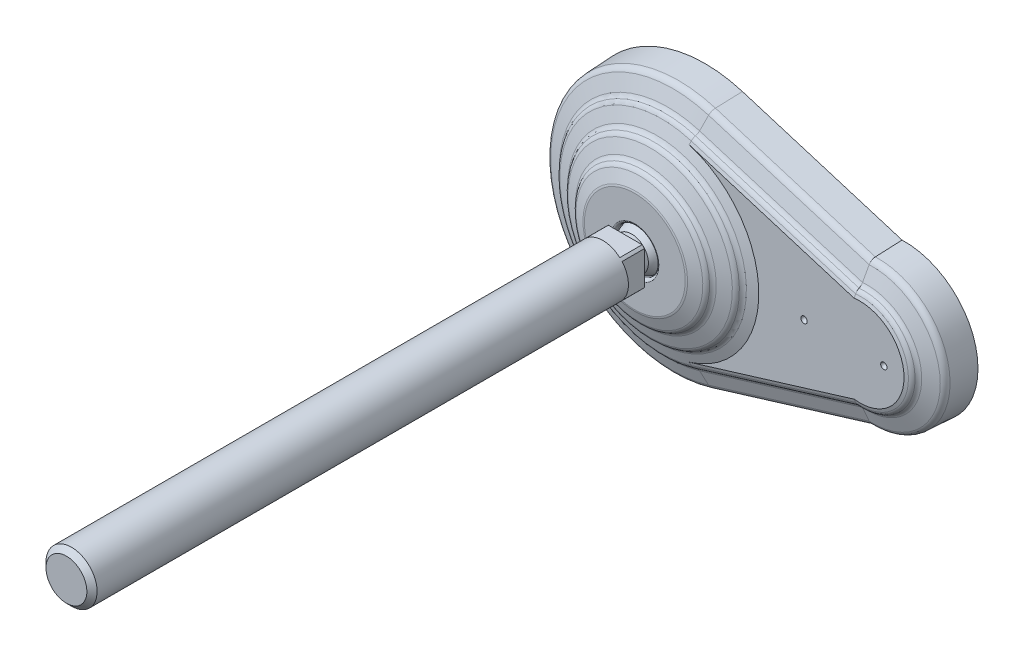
ISO-10303-21;
HEADER;
FILE_DESCRIPTION(('STEP AP214'),'2;1');
FILE_NAME('part.step','',(''),(''),'','','');
FILE_SCHEMA(('AUTOMOTIVE_DESIGN { 1 0 10303 214 1 1 1 1 }'));
ENDSEC;
DATA;
#1=APPLICATION_CONTEXT('core data for automotive mechanical design processes');
#2=APPLICATION_PROTOCOL_DEFINITION('international standard','automotive_design',2000,#1);
#3=PRODUCT_CONTEXT('',#1,'mechanical');
#4=PRODUCT('Part','Part','',(#3));
#5=PRODUCT_RELATED_PRODUCT_CATEGORY('part','',(#4));
#6=PRODUCT_DEFINITION_FORMATION('','',#4);
#7=PRODUCT_DEFINITION_CONTEXT('part definition',#1,'design');
#8=PRODUCT_DEFINITION('design','',#6,#7);
#9=PRODUCT_DEFINITION_SHAPE('','',#8);
#10=(LENGTH_UNIT() NAMED_UNIT(*) SI_UNIT(.MILLI.,.METRE.));
#11=(NAMED_UNIT(*) PLANE_ANGLE_UNIT() SI_UNIT($,.RADIAN.));
#12=(NAMED_UNIT(*) SI_UNIT($,.STERADIAN.) SOLID_ANGLE_UNIT());
#13=UNCERTAINTY_MEASURE_WITH_UNIT(LENGTH_MEASURE(1.E-05),#10,'distance_accuracy_value','');
#14=(GEOMETRIC_REPRESENTATION_CONTEXT(3) GLOBAL_UNCERTAINTY_ASSIGNED_CONTEXT((#13)) GLOBAL_UNIT_ASSIGNED_CONTEXT((#10,
#11,#12)) REPRESENTATION_CONTEXT('',''));
#15=CARTESIAN_POINT('',(0.,0.,0.));
#16=DIRECTION('',(0.,0.,1.));
#17=DIRECTION('',(1.,0.,0.));
#18=AXIS2_PLACEMENT_3D('',#15,#16,#17);
#19=CARTESIAN_POINT('',(0.,0.,34.));
#20=DIRECTION('',(0.,0.,1.));
#21=DIRECTION('',(-1.,0.,0.));
#22=AXIS2_PLACEMENT_3D('',#19,#20,#21);
#23=CYLINDRICAL_SURFACE('',#22,8.);
#24=CARTESIAN_POINT('',(0.,0.,200.4));
#25=DIRECTION('',(0.,0.,1.));
#26=DIRECTION('',(-1.,0.,0.));
#27=AXIS2_PLACEMENT_3D('',#24,#25,#26);
#28=CIRCLE('',#27,8.);
#29=CARTESIAN_POINT('',(-8.,0.,200.4));
#30=VERTEX_POINT('',#29);
#31=EDGE_CURVE('E9',#30,#30,#28,.F.);
#32=ORIENTED_EDGE('',*,*,#31,.T.);
#33=EDGE_LOOP('',(#32));
#34=FACE_BOUND('',#33,.T.);
#35=DIRECTION('',(0.,0.,1.));
#36=VECTOR('',#35,1.);
#37=CARTESIAN_POINT('',(-5.29150262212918,-6.,34.));
#38=LINE('',#37,#36);
#39=CARTESIAN_POINT('',(-5.29150262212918,-6.,34.));
#40=VERTEX_POINT('',#39);
#41=CARTESIAN_POINT('',(-5.29150262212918,-6.,27.));
#42=VERTEX_POINT('',#41);
#43=EDGE_CURVE('E415',#40,#42,#38,.F.);
#44=ORIENTED_EDGE('',*,*,#43,.F.);
#45=CARTESIAN_POINT('',(0.,0.,34.));
#46=DIRECTION('',(0.,0.,1.));
#47=DIRECTION('',(0.,-1.,0.));
#48=AXIS2_PLACEMENT_3D('',#45,#46,#47);
#49=CIRCLE('',#48,8.);
#50=CARTESIAN_POINT('',(5.29150262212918,-6.,34.));
#51=VERTEX_POINT('',#50);
#52=EDGE_CURVE('E500',#40,#51,#49,.T.);
#53=ORIENTED_EDGE('',*,*,#52,.T.);
#54=DIRECTION('',(0.,0.,1.));
#55=VECTOR('',#54,1.);
#56=CARTESIAN_POINT('',(5.29150262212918,-6.,34.));
#57=LINE('',#56,#55);
#58=CARTESIAN_POINT('',(5.29150262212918,-6.,27.));
#59=VERTEX_POINT('',#58);
#60=EDGE_CURVE('E420',#59,#51,#57,.T.);
#61=ORIENTED_EDGE('',*,*,#60,.F.);
#62=CARTESIAN_POINT('',(0.,0.,27.));
#63=DIRECTION('',(0.,0.,1.));
#64=DIRECTION('',(-1.,0.,0.));
#65=AXIS2_PLACEMENT_3D('',#62,#63,#64);
#66=CIRCLE('',#65,8.);
#67=CARTESIAN_POINT('',(6.,-5.29150262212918,27.));
#68=VERTEX_POINT('',#67);
#69=EDGE_CURVE('E533',#59,#68,#66,.T.);
#70=ORIENTED_EDGE('',*,*,#69,.T.);
#71=DIRECTION('',(0.,0.,1.));
#72=VECTOR('',#71,1.);
#73=CARTESIAN_POINT('',(6.,-5.29150262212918,34.));
#74=LINE('',#73,#72);
#75=CARTESIAN_POINT('',(6.,-5.29150262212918,34.));
#76=VERTEX_POINT('',#75);
#77=EDGE_CURVE('E423',#76,#68,#74,.F.);
#78=ORIENTED_EDGE('',*,*,#77,.F.);
#79=CARTESIAN_POINT('',(6.,5.29150262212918,34.));
#80=VERTEX_POINT('',#79);
#81=EDGE_CURVE('E417',#76,#80,#49,.T.);
#82=ORIENTED_EDGE('',*,*,#81,.T.);
#83=DIRECTION('',(0.,0.,1.));
#84=VECTOR('',#83,1.);
#85=CARTESIAN_POINT('',(6.,5.29150262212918,34.));
#86=LINE('',#85,#84);
#87=CARTESIAN_POINT('',(6.,5.29150262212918,27.));
#88=VERTEX_POINT('',#87);
#89=EDGE_CURVE('E433',#88,#80,#86,.T.);
#90=ORIENTED_EDGE('',*,*,#89,.F.);
#91=CARTESIAN_POINT('',(5.29150262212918,6.,27.));
#92=VERTEX_POINT('',#91);
#93=EDGE_CURVE('E531',#88,#92,#66,.T.);
#94=ORIENTED_EDGE('',*,*,#93,.T.);
#95=DIRECTION('',(0.,0.,1.));
#96=VECTOR('',#95,1.);
#97=CARTESIAN_POINT('',(5.29150262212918,6.,34.));
#98=LINE('',#97,#96);
#99=CARTESIAN_POINT('',(5.29150262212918,6.,34.));
#100=VERTEX_POINT('',#99);
#101=EDGE_CURVE('E436',#100,#92,#98,.F.);
#102=ORIENTED_EDGE('',*,*,#101,.F.);
#103=CARTESIAN_POINT('',(-5.29150262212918,6.,34.));
#104=VERTEX_POINT('',#103);
#105=EDGE_CURVE('E499',#100,#104,#49,.T.);
#106=ORIENTED_EDGE('',*,*,#105,.T.);
#107=DIRECTION('',(0.,0.,1.));
#108=VECTOR('',#107,1.);
#109=CARTESIAN_POINT('',(-5.29150262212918,6.,34.));
#110=LINE('',#109,#108);
#111=CARTESIAN_POINT('',(-5.29150262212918,6.,27.));
#112=VERTEX_POINT('',#111);
#113=EDGE_CURVE('E447',#112,#104,#110,.T.);
#114=ORIENTED_EDGE('',*,*,#113,.F.);
#115=CARTESIAN_POINT('',(-6.,5.29150262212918,27.));
#116=VERTEX_POINT('',#115);
#117=EDGE_CURVE('E460',#112,#116,#66,.T.);
#118=ORIENTED_EDGE('',*,*,#117,.T.);
#119=DIRECTION('',(0.,0.,1.));
#120=VECTOR('',#119,1.);
#121=CARTESIAN_POINT('',(-6.,5.29150262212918,34.));
#122=LINE('',#121,#120);
#123=CARTESIAN_POINT('',(-6.,5.29150262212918,34.));
#124=VERTEX_POINT('',#123);
#125=EDGE_CURVE('E450',#124,#116,#122,.F.);
#126=ORIENTED_EDGE('',*,*,#125,.F.);
#127=CARTESIAN_POINT('',(-6.,-5.29150262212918,34.));
#128=VERTEX_POINT('',#127);
#129=EDGE_CURVE('E493',#124,#128,#49,.T.);
#130=ORIENTED_EDGE('',*,*,#129,.T.);
#131=DIRECTION('',(0.,0.,1.));
#132=VECTOR('',#131,1.);
#133=CARTESIAN_POINT('',(-6.,-5.29150262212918,34.));
#134=LINE('',#133,#132);
#135=CARTESIAN_POINT('',(-6.,-5.29150262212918,27.));
#136=VERTEX_POINT('',#135);
#137=EDGE_CURVE('E458',#136,#128,#134,.T.);
#138=ORIENTED_EDGE('',*,*,#137,.F.);
#139=EDGE_CURVE('E404',#136,#42,#66,.T.);
#140=ORIENTED_EDGE('',*,*,#139,.T.);
#141=EDGE_LOOP('',(#44,#53,#61,#70,#78,#82,#90,#94,#102,#106,#114,#118,#126,#130,#138,#140));
#142=FACE_BOUND('',#141,.T.);
#143=ADVANCED_FACE('F15',(#34,#142),#23,.T.);
#144=CARTESIAN_POINT('',(64.1644462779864,-21.755748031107,10.3041173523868));
#145=DIRECTION('',(-0.291971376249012,0.9549953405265,-0.0523126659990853));
#146=DIRECTION('',(-0.956304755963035,-0.292371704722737,0.));
#147=AXIS2_PLACEMENT_3D('',#144,#145,#146);
#148=PLANE('',#147);
#149=CARTESIAN_POINT('',(61.6406997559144,-22.5273238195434,10.3043173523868));
#150=CARTESIAN_POINT('',(61.6501805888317,-22.600242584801,8.92023165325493));
#151=CARTESIAN_POINT('',(61.6596900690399,-22.6731526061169,7.53614569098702));
#152=CARTESIAN_POINT('',(61.6787663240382,-22.8189551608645,4.76797324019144));
#153=CARTESIAN_POINT('',(61.6883330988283,-22.8918476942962,3.38388675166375));
#154=CARTESIAN_POINT('',(61.6979285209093,-22.9647314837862,1.9998));
#155=B_SPLINE_CURVE_WITH_KNOTS('',3,(#149,#150,#151,#152,#153,#154),.UNSPECIFIED.,.F.,.F.,(4,2,
4),(0.,4.15811282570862,8.31622565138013),.UNSPECIFIED.);
#156=CARTESIAN_POINT('',(61.6407011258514,-22.5273343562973,10.3041173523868));
#157=VERTEX_POINT('',#156);
#158=CARTESIAN_POINT('',(61.697927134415,-22.9647209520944,2.));
#159=VERTEX_POINT('',#158);
#160=EDGE_CURVE('E1095',#157,#159,#155,.T.);
#161=ORIENTED_EDGE('',*,*,#160,.F.);
#162=DIRECTION('',(-0.956304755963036,-0.292371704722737,0.));
#163=VECTOR('',#162,1.);
#164=CARTESIAN_POINT('',(64.1644462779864,-21.755748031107,10.3041173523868));
#165=LINE('',#164,#163);
#166=CARTESIAN_POINT('',(11.5676847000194,-37.8361917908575,10.3041173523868));
#167=VERTEX_POINT('',#166);
#168=EDGE_CURVE('E1156',#157,#167,#165,.T.);
#169=ORIENTED_EDGE('',*,*,#168,.T.);
#170=DIRECTION('',(-0.0152947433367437,0.050026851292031,0.998630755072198));
#171=VECTOR('',#170,1.);
#172=CARTESIAN_POINT('',(11.6948681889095,-38.2521902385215,2.));
#173=LINE('',#172,#171);
#174=CARTESIAN_POINT('',(11.6948681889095,-38.2521902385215,2.));
#175=VERTEX_POINT('',#174);
#176=EDGE_CURVE('E1166',#175,#167,#173,.T.);
#177=ORIENTED_EDGE('',*,*,#176,.F.);
#178=DIRECTION('',(-0.956304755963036,-0.292371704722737,0.));
#179=VECTOR('',#178,1.);
#180=CARTESIAN_POINT('',(64.2916297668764,-22.1717464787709,2.));
#181=LINE('',#180,#179);
#182=EDGE_CURVE('E186',#159,#175,#181,.T.);
#183=ORIENTED_EDGE('',*,*,#182,.F.);
#184=EDGE_LOOP('',(#161,#169,#177,#183));
#185=FACE_BOUND('',#184,.T.);
#186=ADVANCED_FACE('F353',(#185),#148,.F.);
#187=CARTESIAN_POINT('',(61.6120778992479,-13.407327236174,16.));
#188=DIRECTION('',(-0.102070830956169,0.333858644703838,-0.937080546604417));
#189=DIRECTION('',(0.,0.942000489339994,0.335611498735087));
#190=AXIS2_PLACEMENT_3D('',#187,#188,#189);
#191=PLANE('',#190);
#192=CARTESIAN_POINT('',(60.6773763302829,-13.6925328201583,16.0002));
#193=CARTESIAN_POINT('',(60.6914441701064,-13.863175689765,15.9378718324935));
#194=CARTESIAN_POINT('',(60.7058313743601,-14.0337829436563,15.8755215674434));
#195=CARTESIAN_POINT('',(60.735244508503,-14.3749261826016,15.7507768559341));
#196=CARTESIAN_POINT('',(60.750270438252,-14.5454621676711,15.6883824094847));
#197=CARTESIAN_POINT('',(60.7656157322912,-14.7159625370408,15.6259658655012));
#198=B_SPLINE_CURVE_WITH_KNOTS('',3,(#192,#193,#194,#195,#196,#197),.UNSPECIFIED.,.F.,.F.,(4,2,
4),(0.,0.546637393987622,1.09327466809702),.UNSPECIFIED.);
#199=CARTESIAN_POINT('',(60.677421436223,-13.6930803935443,16.));
#200=VERTEX_POINT('',#199);
#201=CARTESIAN_POINT('',(60.765566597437,-14.7154161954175,15.6261658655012));
#202=VERTEX_POINT('',#201);
#203=EDGE_CURVE('E166',#200,#202,#198,.T.);
#204=ORIENTED_EDGE('',*,*,#203,.F.);
#205=DIRECTION('',(-0.956304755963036,-0.292371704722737,0.));
#206=VECTOR('',#205,1.);
#207=CARTESIAN_POINT('',(61.6120778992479,-13.407327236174,16.));
#208=LINE('',#207,#206);
#209=CARTESIAN_POINT('',(9.01531632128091,-29.4877709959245,16.));
#210=VERTEX_POINT('',#209);
#211=EDGE_CURVE('E170',#200,#210,#208,.T.);
#212=ORIENTED_EDGE('',*,*,#211,.T.);
#213=DIRECTION('',(-0.273975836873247,0.896134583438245,0.349113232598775));
#214=VECTOR('',#213,1.);
#215=CARTESIAN_POINT('',(9.30869253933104,-30.4473613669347,15.6261658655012));
#216=LINE('',#215,#214);
#217=CARTESIAN_POINT('',(9.30869253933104,-30.4473613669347,15.6261658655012));
#218=VERTEX_POINT('',#217);
#219=EDGE_CURVE('E1181',#218,#210,#216,.T.);
#220=ORIENTED_EDGE('',*,*,#219,.F.);
#221=DIRECTION('',(-0.956304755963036,-0.292371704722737,0.));
#222=VECTOR('',#221,1.);
#223=CARTESIAN_POINT('',(61.905454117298,-14.3669176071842,15.6261658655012));
#224=LINE('',#223,#222);
#225=EDGE_CURVE('E172',#202,#218,#224,.T.);
#226=ORIENTED_EDGE('',*,*,#225,.F.);
#227=EDGE_LOOP('',(#204,#212,#220,#226));
#228=FACE_BOUND('',#227,.T.);
#229=ADVANCED_FACE('F168',(#228),#191,.F.);
#230=CARTESIAN_POINT('',(62.7507979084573,-17.131912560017,15.5370123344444));
#231=DIRECTION('',(-0.956304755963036,-0.292371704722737,0.));
#232=DIRECTION('',(0.292371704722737,-0.956304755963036,0.));
#233=AXIS2_PLACEMENT_3D('',#230,#231,#232);
#234=CYLINDRICAL_SURFACE('',#233,2.00700000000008);
#235=DIRECTION('',(-0.956304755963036,-0.292371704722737,0.));
#236=VECTOR('',#235,1.);
#237=CARTESIAN_POINT('',(62.545973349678,-16.4619616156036,13.656251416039));
#238=LINE('',#237,#236);
#239=CARTESIAN_POINT('',(60.9818619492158,-16.9401584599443,13.656251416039));
#240=VERTEX_POINT('',#239);
#241=CARTESIAN_POINT('',(9.949211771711,-32.5424053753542,13.656251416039));
#242=VERTEX_POINT('',#241);
#243=EDGE_CURVE('E1160',#240,#242,#238,.T.);
#244=ORIENTED_EDGE('',*,*,#243,.F.);
#245=CARTESIAN_POINT('',(60.9819185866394,-16.9407028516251,13.656051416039));
#246=CARTESIAN_POINT('',(60.9763282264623,-16.8869710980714,13.675784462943));
#247=CARTESIAN_POINT('',(60.9708503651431,-16.8340792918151,13.697757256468));
#248=CARTESIAN_POINT('',(60.9601474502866,-16.7302929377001,13.7460604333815));
#249=CARTESIAN_POINT('',(60.9549224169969,-16.6793985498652,13.77239116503));
#250=CARTESIAN_POINT('',(60.9396574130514,-16.5300811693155,13.8578002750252));
#251=CARTESIAN_POINT('',(60.9300410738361,-16.4351542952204,13.9232476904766));
#252=CARTESIAN_POINT('',(60.9121877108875,-16.2575900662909,14.0693279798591));
#253=CARTESIAN_POINT('',(60.903952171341,-16.1749659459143,14.1499769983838));
#254=CARTESIAN_POINT('',(60.8890756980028,-16.0247595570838,14.3241094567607));
#255=CARTESIAN_POINT('',(60.8824301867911,-15.9571341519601,14.4175548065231));
#256=CARTESIAN_POINT('',(60.8754548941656,-15.8858007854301,14.5364334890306));
#257=CARTESIAN_POINT('',(60.8742920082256,-15.8738939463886,14.5571086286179));
#258=CARTESIAN_POINT('',(60.8720425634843,-15.8508368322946,14.59885583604));
#259=CARTESIAN_POINT('',(60.8709559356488,-15.839685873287,14.6199275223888));
#260=CARTESIAN_POINT('',(60.869906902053,-15.8289098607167,14.6412000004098));
#261=B_SPLINE_CURVE_WITH_KNOTS('',3,(#245,#246,#247,#248,#249,#250,#251,#252,#253,#254,#255,
#256,#257,#258,#259,#260),.UNSPECIFIED.,.F.,.F.,(4,2,2,2,2,2,2,4),(0.,0.172434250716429,
0.344882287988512,0.690191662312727,1.0358698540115,1.38054058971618,1.4521941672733,
1.52378201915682),.UNSPECIFIED.);
#262=CARTESIAN_POINT('',(60.8699167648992,-15.8290111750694,14.6410000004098));
#263=VERTEX_POINT('',#262);
#264=EDGE_CURVE('E278',#240,#263,#261,.T.);
#265=ORIENTED_EDGE('',*,*,#264,.T.);
#266=DIRECTION('',(-0.956304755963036,-0.292371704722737,0.));
#267=VECTOR('',#266,1.);
#268=CARTESIAN_POINT('',(62.2257313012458,-15.4144970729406,14.6410000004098));
#269=LINE('',#268,#267);
#270=CARTESIAN_POINT('',(9.62896972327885,-31.4949408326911,14.6410000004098));
#271=VERTEX_POINT('',#270);
#272=EDGE_CURVE('E1162',#263,#271,#269,.T.);
#273=ORIENTED_EDGE('',*,*,#272,.T.);
#274=CARTESIAN_POINT('',(10.1540363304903,-33.2123563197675,15.5370123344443));
#275=DIRECTION('',(0.956304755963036,0.292371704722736,0.));
#276=DIRECTION('',(-0.292371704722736,0.956304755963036,0.));
#277=AXIS2_PLACEMENT_3D('',#274,#275,#276);
#278=CIRCLE('',#277,2.00700000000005);
#279=EDGE_CURVE('E1175',#242,#271,#278,.T.);
#280=ORIENTED_EDGE('',*,*,#279,.F.);
#281=EDGE_LOOP('',(#244,#265,#273,#280));
#282=FACE_BOUND('',#281,.T.);
#283=ADVANCED_FACE('F330',(#282),#234,.F.);
#284=CARTESIAN_POINT('',(62.545973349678,-16.4619616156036,13.656251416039));
#285=DIRECTION('',(-0.102055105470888,0.333807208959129,-0.937100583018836));
#286=DIRECTION('',(0.,0.942019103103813,0.335559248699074));
#287=AXIS2_PLACEMENT_3D('',#284,#285,#286);
#288=PLANE('',#287);
#289=CARTESIAN_POINT('',(60.9818053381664,-16.9396143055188,13.656451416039));
#290=CARTESIAN_POINT('',(61.0189355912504,-17.2964789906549,13.5252879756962));
#291=CARTESIAN_POINT('',(61.0571375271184,-17.653206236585,13.3940567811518));
#292=CARTESIAN_POINT('',(61.1355151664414,-18.3663907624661,13.1314756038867));
#293=CARTESIAN_POINT('',(61.1756908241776,-18.7228480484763,13.0001256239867));
#294=CARTESIAN_POINT('',(61.2578477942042,-19.435511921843,12.7373183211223));
#295=CARTESIAN_POINT('',(61.2998290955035,-19.7917185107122,12.6058609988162));
#296=CARTESIAN_POINT('',(61.3854616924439,-20.5039033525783,12.3428458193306));
#297=CARTESIAN_POINT('',(61.4291130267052,-20.8598816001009,12.2112879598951));
#298=CARTESIAN_POINT('',(61.4735304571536,-21.2157475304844,12.0796866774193));
#299=B_SPLINE_CURVE_WITH_KNOTS('',3,(#289,#290,#291,#292,#293,#294,#295,#296,#297,#298),
.UNSPECIFIED.,.F.,.F.,(4,2,2,2,4),(0.,1.14603990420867,2.29205327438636,3.43805966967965,
4.58409258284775),.UNSPECIFIED.);
#300=CARTESIAN_POINT('',(61.4734629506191,-21.2152067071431,12.0798866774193));
#301=VERTEX_POINT('',#300);
#302=EDGE_CURVE('E311',#240,#301,#299,.T.);
#303=ORIENTED_EDGE('',*,*,#302,.F.);
#304=ORIENTED_EDGE('',*,*,#243,.T.);
#305=DIRECTION('',(-0.273981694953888,0.896153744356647,0.349059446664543));
#306=VECTOR('',#305,1.);
#307=CARTESIAN_POINT('',(11.1865227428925,-36.5894672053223,12.0798866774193));
#308=LINE('',#307,#306);
#309=CARTESIAN_POINT('',(11.1865227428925,-36.5894672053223,12.0798866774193));
#310=VERTEX_POINT('',#309);
#311=EDGE_CURVE('E1172',#310,#242,#308,.T.);
#312=ORIENTED_EDGE('',*,*,#311,.F.);
#313=DIRECTION('',(-0.956304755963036,-0.292371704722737,0.));
#314=VECTOR('',#313,1.);
#315=CARTESIAN_POINT('',(63.7832843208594,-20.5090234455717,12.0798866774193));
#316=LINE('',#315,#314);
#317=EDGE_CURVE('E1158',#301,#310,#316,.T.);
#318=ORIENTED_EDGE('',*,*,#317,.F.);
#319=EDGE_LOOP('',(#303,#304,#312,#318));
#320=FACE_BOUND('',#319,.T.);
#321=ADVANCED_FACE('F325',(#320),#288,.F.);
#322=CARTESIAN_POINT('',(64.2916297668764,22.1717464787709,2.));
#323=DIRECTION('',(-0.291971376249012,-0.9549953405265,-0.0523126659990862));
#324=DIRECTION('',(0.956304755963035,-0.292371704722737,0.));
#325=AXIS2_PLACEMENT_3D('',#322,#323,#324);
#326=PLANE('',#325);
#327=CARTESIAN_POINT('',(61.6979285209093,22.9647314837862,1.9998));
#328=CARTESIAN_POINT('',(61.6883330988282,22.8918476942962,3.38388675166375));
#329=CARTESIAN_POINT('',(61.6787663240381,22.8189551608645,4.76797324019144));
#330=CARTESIAN_POINT('',(61.6596900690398,22.6731526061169,7.53614569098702));
#331=CARTESIAN_POINT('',(61.6501805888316,22.600242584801,8.92023165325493));
#332=CARTESIAN_POINT('',(61.6406997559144,22.5273238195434,10.3043173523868));
#333=B_SPLINE_CURVE_WITH_KNOTS('',3,(#327,#328,#329,#330,#331,#332),.UNSPECIFIED.,.F.,.F.,(4,2,
4),(0.,4.15811282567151,8.31622565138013),.UNSPECIFIED.);
#334=CARTESIAN_POINT('',(61.6979271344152,22.9647209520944,2.));
#335=VERTEX_POINT('',#334);
#336=CARTESIAN_POINT('',(61.6407011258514,22.5273343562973,10.3041173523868));
#337=VERTEX_POINT('',#336);
#338=EDGE_CURVE('E1088',#335,#337,#333,.T.);
#339=ORIENTED_EDGE('',*,*,#338,.F.);
#340=DIRECTION('',(-0.956304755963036,0.292371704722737,0.));
#341=VECTOR('',#340,1.);
#342=CARTESIAN_POINT('',(64.2916297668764,22.1717464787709,2.));
#343=LINE('',#342,#341);
#344=CARTESIAN_POINT('',(11.6948681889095,38.2521902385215,2.));
#345=VERTEX_POINT('',#344);
#346=EDGE_CURVE('E1154',#335,#345,#343,.T.);
#347=ORIENTED_EDGE('',*,*,#346,.T.);
#348=DIRECTION('',(-0.0152947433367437,-0.050026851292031,0.998630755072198));
#349=VECTOR('',#348,1.);
#350=CARTESIAN_POINT('',(11.6948681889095,38.2521902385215,2.));
#351=LINE('',#350,#349);
#352=CARTESIAN_POINT('',(11.5676847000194,37.8361917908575,10.3041173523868));
#353=VERTEX_POINT('',#352);
#354=EDGE_CURVE('E1183',#345,#353,#351,.T.);
#355=ORIENTED_EDGE('',*,*,#354,.T.);
#356=DIRECTION('',(-0.956304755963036,0.292371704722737,0.));
#357=VECTOR('',#356,1.);
#358=CARTESIAN_POINT('',(64.1644462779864,21.755748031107,10.3041173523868));
#359=LINE('',#358,#357);
#360=EDGE_CURVE('E1152',#337,#353,#359,.T.);
#361=ORIENTED_EDGE('',*,*,#360,.F.);
#362=EDGE_LOOP('',(#339,#347,#355,#361));
#363=FACE_BOUND('',#362,.T.);
#364=ADVANCED_FACE('F329',(#363),#326,.F.);
#365=CARTESIAN_POINT('',(63.7832843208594,20.5090234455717,12.0798866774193));
#366=DIRECTION('',(-0.102055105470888,-0.333807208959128,-0.937100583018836));
#367=DIRECTION('',(0.,0.942019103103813,-0.335559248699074));
#368=AXIS2_PLACEMENT_3D('',#365,#366,#367);
#369=PLANE('',#368);
#370=CARTESIAN_POINT('',(61.4735304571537,21.2157475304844,12.0796866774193));
#371=CARTESIAN_POINT('',(61.4291130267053,20.8598816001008,12.2112879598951));
#372=CARTESIAN_POINT('',(61.3854616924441,20.5039033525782,12.3428458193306));
#373=CARTESIAN_POINT('',(61.2998290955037,19.7917185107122,12.6058609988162));
#374=CARTESIAN_POINT('',(61.2578477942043,19.435511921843,12.7373183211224));
#375=CARTESIAN_POINT('',(61.1756908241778,18.7228480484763,13.0001256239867));
#376=CARTESIAN_POINT('',(61.1355151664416,18.3663907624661,13.1314756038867));
#377=CARTESIAN_POINT('',(61.0571375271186,17.653206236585,13.3940567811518));
#378=CARTESIAN_POINT('',(61.0189355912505,17.2964789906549,13.5252879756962));
#379=CARTESIAN_POINT('',(60.9818053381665,16.9396143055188,13.656451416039));
#380=B_SPLINE_CURVE_WITH_KNOTS('',3,(#370,#371,#372,#373,#374,#375,#376,#377,#378,#379),
.UNSPECIFIED.,.F.,.F.,(4,2,2,2,4),(0.,1.14603291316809,2.29203930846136,3.43805267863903,
4.58409258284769),.UNSPECIFIED.);
#381=CARTESIAN_POINT('',(61.4734629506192,21.2152067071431,12.0798866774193));
#382=VERTEX_POINT('',#381);
#383=CARTESIAN_POINT('',(60.9818619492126,16.9401584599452,13.656251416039));
#384=VERTEX_POINT('',#383);
#385=EDGE_CURVE('E305',#382,#384,#380,.T.);
#386=ORIENTED_EDGE('',*,*,#385,.F.);
#387=DIRECTION('',(-0.956304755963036,0.292371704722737,0.));
#388=VECTOR('',#387,1.);
#389=CARTESIAN_POINT('',(63.7832843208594,20.5090234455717,12.0798866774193));
#390=LINE('',#389,#388);
#391=CARTESIAN_POINT('',(11.1865227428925,36.5894672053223,12.0798866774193));
#392=VERTEX_POINT('',#391);
#393=EDGE_CURVE('E1150',#382,#392,#390,.T.);
#394=ORIENTED_EDGE('',*,*,#393,.T.);
#395=DIRECTION('',(-0.273981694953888,-0.896153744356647,0.349059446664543));
#396=VECTOR('',#395,1.);
#397=CARTESIAN_POINT('',(11.1865227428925,36.5894672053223,12.0798866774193));
#398=LINE('',#397,#396);
#399=CARTESIAN_POINT('',(9.949211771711,32.5424053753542,13.656251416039));
#400=VERTEX_POINT('',#399);
#401=EDGE_CURVE('E1189',#392,#400,#398,.T.);
#402=ORIENTED_EDGE('',*,*,#401,.T.);
#403=DIRECTION('',(-0.956304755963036,0.292371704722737,0.));
#404=VECTOR('',#403,1.);
#405=CARTESIAN_POINT('',(62.545973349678,16.4619616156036,13.656251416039));
#406=LINE('',#405,#404);
#407=EDGE_CURVE('E1148',#384,#400,#406,.T.);
#408=ORIENTED_EDGE('',*,*,#407,.F.);
#409=EDGE_LOOP('',(#386,#394,#402,#408));
#410=FACE_BOUND('',#409,.T.);
#411=ADVANCED_FACE('F266',(#410),#369,.F.);
#412=CARTESIAN_POINT('',(62.7507979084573,17.1319125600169,15.5370123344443));
#413=DIRECTION('',(-0.956304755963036,0.292371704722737,0.));
#414=DIRECTION('',(-0.292371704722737,-0.956304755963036,0.));
#415=AXIS2_PLACEMENT_3D('',#412,#413,#414);
#416=CYLINDRICAL_SURFACE('',#415,2.007);
#417=DIRECTION('',(-0.956304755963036,0.292371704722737,0.));
#418=VECTOR('',#417,1.);
#419=CARTESIAN_POINT('',(62.2257313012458,15.4144970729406,14.6410000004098));
#420=LINE('',#419,#418);
#421=CARTESIAN_POINT('',(60.8699167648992,15.8290111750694,14.6410000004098));
#422=VERTEX_POINT('',#421);
#423=CARTESIAN_POINT('',(9.62896972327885,31.4949408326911,14.6410000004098));
#424=VERTEX_POINT('',#423);
#425=EDGE_CURVE('E1146',#422,#424,#420,.T.);
#426=ORIENTED_EDGE('',*,*,#425,.F.);
#427=CARTESIAN_POINT('',(60.869906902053,15.8289098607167,14.6412000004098));
#428=CARTESIAN_POINT('',(60.8724049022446,15.8545692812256,14.5905409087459));
#429=CARTESIAN_POINT('',(60.8751177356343,15.882373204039,14.5410120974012));
#430=CARTESIAN_POINT('',(60.8809599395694,15.9420653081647,14.4445128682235));
#431=CARTESIAN_POINT('',(60.8840892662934,15.9739530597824,14.3975421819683));
#432=CARTESIAN_POINT('',(60.8940798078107,16.0754098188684,14.2609440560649));
#433=CARTESIAN_POINT('',(60.9015461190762,16.1507985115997,14.1755790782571));
#434=CARTESIAN_POINT('',(60.9179069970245,16.3146445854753,14.0187596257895));
#435=CARTESIAN_POINT('',(60.9268017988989,16.4031041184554,13.9473074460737));
#436=CARTESIAN_POINT('',(60.9458071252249,16.5904449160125,13.8202080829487));
#437=CARTESIAN_POINT('',(60.9559150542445,16.6893038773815,13.7645279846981));
#438=CARTESIAN_POINT('',(60.9690169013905,16.8162843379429,13.7062217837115));
#439=CARTESIAN_POINT('',(60.9715630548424,16.8409104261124,13.6954970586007));
#440=CARTESIAN_POINT('',(60.9767040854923,16.8905299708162,13.6750365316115));
#441=CARTESIAN_POINT('',(60.9792989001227,16.9155229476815,13.6652995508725));
#442=CARTESIAN_POINT('',(60.9819185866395,16.940702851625,13.656051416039));
#443=B_SPLINE_CURVE_WITH_KNOTS('',3,(#427,#428,#429,#430,#431,#432,#433,#434,#435,#436,#437,
#438,#439,#440,#441,#442),.UNSPECIFIED.,.F.,.F.,(4,2,2,2,2,2,2,4),(0.,0.170415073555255,
0.340812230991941,0.68143537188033,1.0221146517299,1.36207763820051,1.44300799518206,
1.52384059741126),.UNSPECIFIED.);
#444=EDGE_CURVE('E271',#422,#384,#443,.T.);
#445=ORIENTED_EDGE('',*,*,#444,.T.);
#446=ORIENTED_EDGE('',*,*,#407,.T.);
#447=CARTESIAN_POINT('',(10.1540363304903,33.2123563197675,15.5370123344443));
#448=DIRECTION('',(-0.956304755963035,0.292371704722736,0.));
#449=DIRECTION('',(-0.292371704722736,-0.956304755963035,0.));
#450=AXIS2_PLACEMENT_3D('',#447,#448,#449);
#451=CIRCLE('',#450,2.00700000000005);
#452=EDGE_CURVE('E1192',#400,#424,#451,.T.);
#453=ORIENTED_EDGE('',*,*,#452,.T.);
#454=EDGE_LOOP('',(#426,#445,#446,#453));
#455=FACE_BOUND('',#454,.T.);
#456=ADVANCED_FACE('F253',(#455),#416,.F.);
#457=CARTESIAN_POINT('',(61.905454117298,14.3669176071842,15.6261658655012));
#458=DIRECTION('',(-0.102070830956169,-0.333858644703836,-0.937080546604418));
#459=DIRECTION('',(0.,0.942000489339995,-0.335611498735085));
#460=AXIS2_PLACEMENT_3D('',#457,#458,#459);
#461=PLANE('',#460);
#462=CARTESIAN_POINT('',(60.7656157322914,14.7159625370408,15.6259658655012));
#463=CARTESIAN_POINT('',(60.750270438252,14.5454621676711,15.6883824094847));
#464=CARTESIAN_POINT('',(60.7352445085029,14.3749261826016,15.7507768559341));
#465=CARTESIAN_POINT('',(60.70583137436,14.0337829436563,15.8755215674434));
#466=CARTESIAN_POINT('',(60.6914441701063,13.863175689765,15.9378718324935));
#467=CARTESIAN_POINT('',(60.6773763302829,13.6925328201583,16.0002));
#468=B_SPLINE_CURVE_WITH_KNOTS('',3,(#462,#463,#464,#465,#466,#467),.UNSPECIFIED.,.F.,.F.,(4,2,
4),(0.,0.546637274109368,1.09327466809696),.UNSPECIFIED.);
#469=CARTESIAN_POINT('',(60.7655665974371,14.7154161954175,15.6261658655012));
#470=VERTEX_POINT('',#469);
#471=CARTESIAN_POINT('',(60.6774214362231,13.6930803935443,16.));
#472=VERTEX_POINT('',#471);
#473=EDGE_CURVE('E191',#470,#472,#468,.T.);
#474=ORIENTED_EDGE('',*,*,#473,.F.);
#475=DIRECTION('',(-0.956304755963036,0.292371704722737,0.));
#476=VECTOR('',#475,1.);
#477=CARTESIAN_POINT('',(61.905454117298,14.3669176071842,15.6261658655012));
#478=LINE('',#477,#476);
#479=CARTESIAN_POINT('',(9.30869253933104,30.4473613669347,15.6261658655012));
#480=VERTEX_POINT('',#479);
#481=EDGE_CURVE('E1144',#470,#480,#478,.T.);
#482=ORIENTED_EDGE('',*,*,#481,.T.);
#483=DIRECTION('',(-0.273975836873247,-0.896134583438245,0.349113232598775));
#484=VECTOR('',#483,1.);
#485=CARTESIAN_POINT('',(9.30869253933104,30.4473613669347,15.6261658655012));
#486=LINE('',#485,#484);
#487=CARTESIAN_POINT('',(9.01531632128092,29.4877709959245,16.));
#488=VERTEX_POINT('',#487);
#489=EDGE_CURVE('E1198',#480,#488,#486,.T.);
#490=ORIENTED_EDGE('',*,*,#489,.T.);
#491=DIRECTION('',(-0.956304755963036,0.292371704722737,0.));
#492=VECTOR('',#491,1.);
#493=CARTESIAN_POINT('',(61.6120778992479,13.4073272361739,16.));
#494=LINE('',#493,#492);
#495=EDGE_CURVE('E1142',#472,#488,#494,.T.);
#496=ORIENTED_EDGE('',*,*,#495,.F.);
#497=EDGE_LOOP('',(#474,#482,#490,#496));
#498=FACE_BOUND('',#497,.T.);
#499=ADVANCED_FACE('F248',(#498),#461,.F.);
#500=CARTESIAN_POINT('',(0.,0.,2.));
#501=DIRECTION('',(0.,0.,1.));
#502=DIRECTION('',(-1.,0.,0.));
#503=AXIS2_PLACEMENT_3D('',#500,#501,#502);
#504=PLANE('',#503);
#505=ORIENTED_EDGE('',*,*,#346,.F.);
#506=CARTESIAN_POINT('',(62.5,0.,2.));
#507=DIRECTION('',(0.,0.,1.));
#508=DIRECTION('',(0.,-1.,0.));
#509=AXIS2_PLACEMENT_3D('',#506,#507,#508);
#510=CIRCLE('',#509,22.9787234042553);
#511=EDGE_CURVE('E177',#159,#335,#510,.T.);
#512=ORIENTED_EDGE('',*,*,#511,.F.);
#513=ORIENTED_EDGE('',*,*,#182,.T.);
#514=CARTESIAN_POINT('',(0.,0.,2.));
#515=DIRECTION('',(0.,0.,1.));
#516=DIRECTION('',(-1.,0.,0.));
#517=AXIS2_PLACEMENT_3D('',#514,#515,#516);
#518=CIRCLE('',#517,40.);
#519=EDGE_CURVE('E244',#345,#175,#518,.T.);
#520=ORIENTED_EDGE('',*,*,#519,.F.);
#521=EDGE_LOOP('',(#505,#512,#513,#520));
#522=FACE_BOUND('',#521,.T.);
#523=CARTESIAN_POINT('',(65.,0.,2.));
#524=DIRECTION('',(0.,0.,1.));
#525=DIRECTION('',(1.,0.,0.));
#526=AXIS2_PLACEMENT_3D('',#523,#524,#525);
#527=CIRCLE('',#526,16.);
#528=CARTESIAN_POINT('',(69.9230769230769,-15.2237746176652,2.));
#529=VERTEX_POINT('',#528);
#530=CARTESIAN_POINT('',(69.9230769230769,15.2237746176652,2.));
#531=VERTEX_POINT('',#530);
#532=EDGE_CURVE('E568',#529,#531,#527,.T.);
#533=ORIENTED_EDGE('',*,*,#532,.T.);
#534=DIRECTION('',(-0.951485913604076,0.307692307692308,0.));
#535=VECTOR('',#534,1.);
#536=CARTESIAN_POINT('',(69.9230769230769,15.2237746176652,2.));
#537=LINE('',#536,#535);
#538=CARTESIAN_POINT('',(11.0769230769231,34.2534928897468,2.));
#539=VERTEX_POINT('',#538);
#540=EDGE_CURVE('E32',#531,#539,#537,.T.);
#541=ORIENTED_EDGE('',*,*,#540,.T.);
#542=CARTESIAN_POINT('',(0.,0.,2.));
#543=DIRECTION('',(0.,0.,1.));
#544=DIRECTION('',(1.,0.,0.));
#545=AXIS2_PLACEMENT_3D('',#542,#543,#544);
#546=CIRCLE('',#545,36.);
#547=CARTESIAN_POINT('',(11.0769230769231,-34.2534928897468,2.));
#548=VERTEX_POINT('',#547);
#549=EDGE_CURVE('E575',#539,#548,#546,.T.);
#550=ORIENTED_EDGE('',*,*,#549,.T.);
#551=DIRECTION('',(0.951485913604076,0.307692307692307,0.));
#552=VECTOR('',#551,1.);
#553=CARTESIAN_POINT('',(11.0769230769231,-34.2534928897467,2.));
#554=LINE('',#553,#552);
#555=EDGE_CURVE('E570',#548,#529,#554,.T.);
#556=ORIENTED_EDGE('',*,*,#555,.T.);
#557=EDGE_LOOP('',(#533,#541,#550,#556));
#558=FACE_BOUND('',#557,.T.);
#559=ADVANCED_FACE('F252',(#522,#558),#504,.F.);
#560=CARTESIAN_POINT('',(0.,0.,2.));
#561=DIRECTION('',(0.,0.,-1.));
#562=DIRECTION('',(1.,0.,0.));
#563=AXIS2_PLACEMENT_3D('',#560,#561,#562);
#564=CONICAL_SURFACE('',#563,40.,0.0523365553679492);
#565=CARTESIAN_POINT('',(0.,0.,10.3041173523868));
#566=DIRECTION('',(0.,0.,1.));
#567=DIRECTION('',(-1.,0.,0.));
#568=AXIS2_PLACEMENT_3D('',#565,#566,#567);
#569=CIRCLE('',#568,39.5649938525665);
#570=EDGE_CURVE('E1212',#353,#167,#569,.T.);
#571=ORIENTED_EDGE('',*,*,#570,.F.);
#572=ORIENTED_EDGE('',*,*,#354,.F.);
#573=ORIENTED_EDGE('',*,*,#519,.T.);
#574=ORIENTED_EDGE('',*,*,#176,.T.);
#575=EDGE_LOOP('',(#571,#572,#573,#574));
#576=FACE_BOUND('',#575,.T.);
#577=ADVANCED_FACE('F1000',(#576),#564,.T.);
#578=CARTESIAN_POINT('',(0.,0.,10.1991258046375));
#579=DIRECTION('',(0.,0.,1.));
#580=DIRECTION('',(-1.,0.,0.));
#581=AXIS2_PLACEMENT_3D('',#578,#579,#580);
#582=TOROIDAL_SURFACE('',#581,37.5607419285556,2.007);
#583=CARTESIAN_POINT('',(0.,0.,12.0798866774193));
#584=DIRECTION('',(0.,0.,1.));
#585=DIRECTION('',(-1.,0.,0.));
#586=AXIS2_PLACEMENT_3D('',#583,#584,#585);
#587=CIRCLE('',#586,38.2613042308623);
#588=EDGE_CURVE('E1210',#392,#310,#587,.T.);
#589=ORIENTED_EDGE('',*,*,#588,.F.);
#590=CARTESIAN_POINT('',(10.9816981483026,35.9195161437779,10.1991258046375));
#591=DIRECTION('',(-0.956304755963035,0.292371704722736,0.));
#592=DIRECTION('',(-0.292371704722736,-0.956304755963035,0.));
#593=AXIS2_PLACEMENT_3D('',#590,#591,#592);
#594=CIRCLE('',#593,2.007);
#595=EDGE_CURVE('E1186',#392,#353,#594,.T.);
#596=ORIENTED_EDGE('',*,*,#595,.T.);
#597=ORIENTED_EDGE('',*,*,#570,.T.);
#598=CARTESIAN_POINT('',(10.9816981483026,-35.9195161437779,10.1991258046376));
#599=DIRECTION('',(0.956304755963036,0.292371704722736,0.));
#600=DIRECTION('',(-0.292371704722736,0.956304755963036,0.));
#601=AXIS2_PLACEMENT_3D('',#598,#599,#600);
#602=CIRCLE('',#601,2.007);
#603=EDGE_CURVE('E1169',#310,#167,#602,.T.);
#604=ORIENTED_EDGE('',*,*,#603,.F.);
#605=EDGE_LOOP('',(#589,#596,#597,#604));
#606=FACE_BOUND('',#605,.T.);
#607=ADVANCED_FACE('F991',(#606),#582,.T.);
#608=CARTESIAN_POINT('',(0.,0.,12.0798866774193));
#609=DIRECTION('',(0.,0.,-1.));
#610=DIRECTION('',(1.,0.,0.));
#611=AXIS2_PLACEMENT_3D('',#608,#609,#610);
#612=CONICAL_SURFACE('',#611,38.2613042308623,1.21422909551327);
#613=CARTESIAN_POINT('',(0.,0.,13.656251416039));
#614=DIRECTION('',(0.,0.,1.));
#615=DIRECTION('',(-1.,0.,0.));
#616=AXIS2_PLACEMENT_3D('',#613,#614,#615);
#617=CIRCLE('',#616,34.0293250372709);
#618=EDGE_CURVE('E1207',#400,#242,#617,.T.);
#619=ORIENTED_EDGE('',*,*,#618,.F.);
#620=ORIENTED_EDGE('',*,*,#401,.F.);
#621=ORIENTED_EDGE('',*,*,#588,.T.);
#622=ORIENTED_EDGE('',*,*,#311,.T.);
#623=EDGE_LOOP('',(#619,#620,#621,#622));
#624=FACE_BOUND('',#623,.T.);
#625=ADVANCED_FACE('F982',(#624),#612,.T.);
#626=CARTESIAN_POINT('',(0.,0.,15.5370123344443));
#627=DIRECTION('',(0.,0.,1.));
#628=DIRECTION('',(-1.,0.,0.));
#629=AXIS2_PLACEMENT_3D('',#626,#627,#628);
#630=TOROIDAL_SURFACE('',#629,34.7298872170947,2.00700000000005);
#631=CARTESIAN_POINT('',(0.,0.,14.6410000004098));
#632=DIRECTION('',(0.,0.,1.));
#633=DIRECTION('',(-1.,0.,0.));
#634=AXIS2_PLACEMENT_3D('',#631,#632,#633);
#635=CIRCLE('',#634,32.9339999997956);
#636=EDGE_CURVE('E1204',#424,#271,#635,.T.);
#637=ORIENTED_EDGE('',*,*,#636,.F.);
#638=ORIENTED_EDGE('',*,*,#452,.F.);
#639=ORIENTED_EDGE('',*,*,#618,.T.);
#640=ORIENTED_EDGE('',*,*,#279,.T.);
#641=EDGE_LOOP('',(#637,#638,#639,#640));
#642=FACE_BOUND('',#641,.T.);
#643=ADVANCED_FACE('F973',(#642),#630,.F.);
#644=CARTESIAN_POINT('',(0.,0.,13.7454451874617));
#645=DIRECTION('',(0.,0.,1.));
#646=DIRECTION('',(-1.,0.,0.));
#647=AXIS2_PLACEMENT_3D('',#644,#645,#646);
#648=TOROIDAL_SURFACE('',#647,31.1378845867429,2.007);
#649=CARTESIAN_POINT('',(0.,0.,15.6261658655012));
#650=DIRECTION('',(0.,0.,1.));
#651=DIRECTION('',(-1.,0.,0.));
#652=AXIS2_PLACEMENT_3D('',#649,#650,#651);
#653=CIRCLE('',#652,31.8385547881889);
#654=EDGE_CURVE('E1201',#480,#218,#653,.T.);
#655=ORIENTED_EDGE('',*,*,#654,.F.);
#656=CARTESIAN_POINT('',(9.10383639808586,29.7773071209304,13.7454451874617));
#657=DIRECTION('',(-0.956304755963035,0.292371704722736,0.));
#658=DIRECTION('',(-0.292371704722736,-0.956304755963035,0.));
#659=AXIS2_PLACEMENT_3D('',#656,#657,#658);
#660=CIRCLE('',#659,2.007);
#661=EDGE_CURVE('E1195',#480,#424,#660,.T.);
#662=ORIENTED_EDGE('',*,*,#661,.T.);
#663=ORIENTED_EDGE('',*,*,#636,.T.);
#664=CARTESIAN_POINT('',(9.10383639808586,-29.7773071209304,13.7454451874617));
#665=DIRECTION('',(0.956304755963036,0.292371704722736,0.));
#666=DIRECTION('',(-0.292371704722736,0.956304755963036,0.));
#667=AXIS2_PLACEMENT_3D('',#664,#665,#666);
#668=CIRCLE('',#667,2.007);
#669=EDGE_CURVE('E1178',#218,#271,#668,.T.);
#670=ORIENTED_EDGE('',*,*,#669,.F.);
#671=EDGE_LOOP('',(#655,#662,#663,#670));
#672=FACE_BOUND('',#671,.T.);
#673=ADVANCED_FACE('F964',(#672),#648,.T.);
#674=CARTESIAN_POINT('',(0.,0.,15.6261658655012));
#675=DIRECTION('',(0.,0.,-1.));
#676=DIRECTION('',(1.,0.,0.));
#677=AXIS2_PLACEMENT_3D('',#674,#675,#676);
#678=CONICAL_SURFACE('',#677,31.8385547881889,1.21417169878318);
#679=CARTESIAN_POINT('',(0.,0.,17.054));
#680=DIRECTION('',(0.,0.,1.));
#681=DIRECTION('',(0.,-1.,0.));
#682=AXIS2_PLACEMENT_3D('',#679,#680,#681);
#683=CIRCLE('',#682,28.006);
#684=CARTESIAN_POINT('',(0.,-28.006,17.054));
#685=VERTEX_POINT('',#684);
#686=EDGE_CURVE('E1109',#685,#685,#683,.T.);
#687=ORIENTED_EDGE('',*,*,#686,.F.);
#688=EDGE_LOOP('',(#687));
#689=FACE_BOUND('',#688,.T.);
#690=CARTESIAN_POINT('',(0.,0.,16.));
#691=DIRECTION('',(0.,0.,1.));
#692=DIRECTION('',(0.,-1.,0.));
#693=AXIS2_PLACEMENT_3D('',#690,#691,#692);
#694=CIRCLE('',#693,30.8351190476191);
#695=EDGE_CURVE('E184',#210,#488,#694,.T.);
#696=ORIENTED_EDGE('',*,*,#695,.T.);
#697=ORIENTED_EDGE('',*,*,#489,.F.);
#698=ORIENTED_EDGE('',*,*,#654,.T.);
#699=ORIENTED_EDGE('',*,*,#219,.T.);
#700=EDGE_LOOP('',(#696,#697,#698,#699));
#701=FACE_BOUND('',#700,.T.);
#702=ADVANCED_FACE('F348',(#689,#701),#678,.T.);
#703=CARTESIAN_POINT('',(9.01531632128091,29.4877709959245,16.));
#704=DIRECTION('',(0.,0.,-1.));
#705=DIRECTION('',(1.,0.,0.));
#706=AXIS2_PLACEMENT_3D('',#703,#704,#705);
#707=PLANE('',#706);
#708=CARTESIAN_POINT('',(45.,0.,16.));
#709=DIRECTION('',(0.,0.,-1.));
#710=DIRECTION('',(0.,1.,0.));
#711=AXIS2_PLACEMENT_3D('',#708,#709,#710);
#712=CIRCLE('',#711,1.);
#713=CARTESIAN_POINT('',(45.,1.,16.));
#714=VERTEX_POINT('',#713);
#715=EDGE_CURVE('E590',#714,#714,#712,.T.);
#716=ORIENTED_EDGE('',*,*,#715,.T.);
#717=EDGE_LOOP('',(#716));
#718=FACE_BOUND('',#717,.T.);
#719=CARTESIAN_POINT('',(70.,0.,16.));
#720=DIRECTION('',(0.,0.,-1.));
#721=DIRECTION('',(0.,1.,0.));
#722=AXIS2_PLACEMENT_3D('',#719,#720,#721);
#723=CIRCLE('',#722,1.);
#724=CARTESIAN_POINT('',(70.,1.,16.));
#725=VERTEX_POINT('',#724);
#726=EDGE_CURVE('E593',#725,#725,#723,.T.);
#727=ORIENTED_EDGE('',*,*,#726,.T.);
#728=EDGE_LOOP('',(#727));
#729=FACE_BOUND('',#728,.T.);
#730=ORIENTED_EDGE('',*,*,#211,.F.);
#731=CARTESIAN_POINT('',(62.5,0.,16.));
#732=DIRECTION('',(0.,0.,1.));
#733=DIRECTION('',(0.,-1.,0.));
#734=AXIS2_PLACEMENT_3D('',#731,#732,#733);
#735=CIRCLE('',#734,13.8138424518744);
#736=EDGE_CURVE('E181',#200,#472,#735,.T.);
#737=ORIENTED_EDGE('',*,*,#736,.T.);
#738=ORIENTED_EDGE('',*,*,#495,.T.);
#739=ORIENTED_EDGE('',*,*,#695,.F.);
#740=EDGE_LOOP('',(#730,#737,#738,#739));
#741=FACE_BOUND('',#740,.T.);
#742=ADVANCED_FACE('F180',(#718,#729,#741),#707,.F.);
#743=CARTESIAN_POINT('',(61.7005979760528,-13.6968633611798,13.7454451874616));
#744=DIRECTION('',(-0.956304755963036,-0.292371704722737,0.));
#745=DIRECTION('',(0.292371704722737,-0.956304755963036,0.));
#746=AXIS2_PLACEMENT_3D('',#743,#744,#745);
#747=CYLINDRICAL_SURFACE('',#746,2.007);
#748=ORIENTED_EDGE('',*,*,#272,.F.);
#749=CARTESIAN_POINT('',(60.8699266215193,-15.8291124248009,14.6408000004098));
#750=CARTESIAN_POINT('',(60.8674327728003,-15.8034938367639,14.6914108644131));
#751=CARTESIAN_POINT('',(60.8647362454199,-15.7757317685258,14.74089344));
#752=CARTESIAN_POINT('',(60.858964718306,-15.7161228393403,14.8373036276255));
#753=CARTESIAN_POINT('',(60.8558897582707,-15.6842764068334,14.8842315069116));
#754=CARTESIAN_POINT('',(60.8461407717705,-15.5829473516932,15.0206941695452));
#755=CARTESIAN_POINT('',(60.8389394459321,-15.5076423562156,15.1059721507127));
#756=CARTESIAN_POINT('',(60.8234284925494,-15.3439431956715,15.2626343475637));
#757=CARTESIAN_POINT('',(60.8151186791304,-15.2555468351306,15.3340162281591));
#758=CARTESIAN_POINT('',(60.7977056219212,-15.0683060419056,15.4610128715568));
#759=CARTESIAN_POINT('',(60.7886040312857,-14.9694832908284,15.5166595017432));
#760=CARTESIAN_POINT('',(60.7770047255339,-14.8420034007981,15.5752115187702));
#761=CARTESIAN_POINT('',(60.7747221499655,-14.8168458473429,15.586159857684));
#762=CARTESIAN_POINT('',(60.7701357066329,-14.7661467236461,15.6070291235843));
#763=CARTESIAN_POINT('',(60.7678318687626,-14.7406056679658,15.6169513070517));
#764=CARTESIAN_POINT('',(60.7655174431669,-14.7148696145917,15.6263658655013));
#765=B_SPLINE_CURVE_WITH_KNOTS('',3,(#749,#750,#751,#752,#753,#754,#755,#756,#757,#758,#759,
#760,#761,#762,#763,#764),.UNSPECIFIED.,.F.,.F.,(4,2,2,2,2,2,2,4),(0.,0.170230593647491,
0.340443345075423,0.680655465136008,1.02092470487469,1.3604998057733,1.44308206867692,
1.52556198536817),.UNSPECIFIED.);
#766=EDGE_CURVE('E279',#263,#202,#765,.T.);
#767=ORIENTED_EDGE('',*,*,#766,.T.);
#768=ORIENTED_EDGE('',*,*,#225,.T.);
#769=ORIENTED_EDGE('',*,*,#669,.T.);
#770=EDGE_LOOP('',(#748,#767,#768,#769));
#771=FACE_BOUND('',#770,.T.);
#772=ADVANCED_FACE('F338',(#771),#747,.T.);
#773=CARTESIAN_POINT('',(63.5784597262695,-19.8390723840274,10.1991258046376));
#774=DIRECTION('',(-0.956304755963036,-0.292371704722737,0.));
#775=DIRECTION('',(0.292371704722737,-0.956304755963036,0.));
#776=AXIS2_PLACEMENT_3D('',#773,#774,#775);
#777=CYLINDRICAL_SURFACE('',#776,2.00699999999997);
#778=ORIENTED_EDGE('',*,*,#168,.F.);
#779=CARTESIAN_POINT('',(61.6407233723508,-22.5275054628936,10.0974340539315));
#780=CARTESIAN_POINT('',(61.6409510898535,-22.5292569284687,10.1317993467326));
#781=CARTESIAN_POINT('',(61.6410635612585,-22.5301219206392,10.1661964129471));
#782=CARTESIAN_POINT('',(61.6410572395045,-22.5300732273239,10.235045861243));
#783=CARTESIAN_POINT('',(61.6409380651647,-22.5291566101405,10.2694982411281));
#784=CARTESIAN_POINT('',(61.6399396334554,-22.5214778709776,10.4153785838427));
#785=CARTESIAN_POINT('',(61.6379561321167,-22.5062239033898,10.526490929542));
#786=CARTESIAN_POINT('',(61.6316126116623,-22.4573679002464,10.7446232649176));
#787=CARTESIAN_POINT('',(61.6272490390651,-22.4237384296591,10.8516368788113));
#788=CARTESIAN_POINT('',(61.6163034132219,-22.339189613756,11.058357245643));
#789=CARTESIAN_POINT('',(61.6097238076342,-22.2882893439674,11.1580719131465));
#790=CARTESIAN_POINT('',(61.5945702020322,-22.1707054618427,11.3475467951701));
#791=CARTESIAN_POINT('',(61.5859960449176,-22.1040206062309,11.4373062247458));
#792=CARTESIAN_POINT('',(61.5670698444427,-21.9562760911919,11.6050783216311));
#793=CARTESIAN_POINT('',(61.5567047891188,-21.8751110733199,11.6829965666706));
#794=CARTESIAN_POINT('',(61.5345911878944,-21.7011851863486,11.8241014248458));
#795=CARTESIAN_POINT('',(61.5228449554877,-21.6084436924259,11.8873121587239));
#796=CARTESIAN_POINT('',(61.5046129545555,-21.4637836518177,11.9692866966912));
#797=CARTESIAN_POINT('',(61.4985079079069,-21.4152343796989,11.9942523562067));
#798=CARTESIAN_POINT('',(61.4860940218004,-21.3162718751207,12.0401972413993));
#799=CARTESIAN_POINT('',(61.4797850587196,-21.2658575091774,12.0611739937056));
#800=CARTESIAN_POINT('',(61.4596293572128,-21.1043762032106,12.1208327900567));
#801=CARTESIAN_POINT('',(61.4454888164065,-20.9904779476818,12.1519983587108));
#802=CARTESIAN_POINT('',(61.4169436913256,-20.7591475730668,12.1941665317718));
#803=CARTESIAN_POINT('',(61.4025394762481,-20.6417202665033,12.2051954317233));
#804=CARTESIAN_POINT('',(61.3876252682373,-20.5193667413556,12.2061070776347));
#805=CARTESIAN_POINT('',(61.3870090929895,-20.5143103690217,12.2061258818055));
#806=CARTESIAN_POINT('',(61.3863931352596,-20.5092543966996,12.2061258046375));
#807=B_SPLINE_CURVE_WITH_KNOTS('',3,(#779,#780,#781,#782,#783,#784,#785,#786,#787,#788,#789,
#790,#791,#792,#793,#794,#795,#796,#797,#798,#799,#800,#801,#802,#803,#804,#805,#806),
.UNSPECIFIED.,.F.,.F.,(4,2,2,2,2,2,2,2,2,2,2,2,2,4),(0.,0.103191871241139,0.20655369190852,
0.541275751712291,0.87649892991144,1.21135305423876,1.54623356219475,1.8836582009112,
2.22052549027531,2.38517216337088,2.54992059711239,2.9048600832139,3.25933573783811,
3.2746170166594),.UNSPECIFIED.);
#808=EDGE_CURVE('E1096',#157,#301,#807,.T.);
#809=ORIENTED_EDGE('',*,*,#808,.T.);
#810=ORIENTED_EDGE('',*,*,#317,.T.);
#811=ORIENTED_EDGE('',*,*,#603,.T.);
#812=EDGE_LOOP('',(#778,#809,#810,#811));
#813=FACE_BOUND('',#812,.T.);
#814=ADVANCED_FACE('F332',(#813),#777,.T.);
#815=CARTESIAN_POINT('',(63.5784597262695,19.8390723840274,10.1991258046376));
#816=DIRECTION('',(-0.956304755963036,0.292371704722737,0.));
#817=DIRECTION('',(-0.292371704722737,-0.956304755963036,0.));
#818=AXIS2_PLACEMENT_3D('',#815,#816,#817);
#819=CYLINDRICAL_SURFACE('',#818,2.00699999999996);
#820=ORIENTED_EDGE('',*,*,#393,.F.);
#821=CARTESIAN_POINT('',(61.3863931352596,20.5092543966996,12.2061258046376));
#822=CARTESIAN_POINT('',(61.3870091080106,20.5143104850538,12.2061258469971));
#823=CARTESIAN_POINT('',(61.3876252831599,20.5193668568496,12.206107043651));
#824=CARTESIAN_POINT('',(61.3988855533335,20.6117442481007,12.2054193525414));
#825=CARTESIAN_POINT('',(61.4095840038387,20.6991031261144,12.1991511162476));
#826=CARTESIAN_POINT('',(61.4308936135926,20.8723273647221,12.1754412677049));
#827=CARTESIAN_POINT('',(61.4415047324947,20.9581920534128,12.1579947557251));
#828=CARTESIAN_POINT('',(61.4555813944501,21.0716202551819,12.1272225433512));
#829=CARTESIAN_POINT('',(61.4591730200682,21.1005182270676,12.1186877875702));
#830=CARTESIAN_POINT('',(61.4663157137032,21.1579059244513,12.1003430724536));
#831=CARTESIAN_POINT('',(61.4698667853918,21.1863956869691,12.090533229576));
#832=CARTESIAN_POINT('',(61.4866782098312,21.3210820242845,12.0407628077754));
#833=CARTESIAN_POINT('',(61.4996430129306,21.4243838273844,11.9924168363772));
#834=CARTESIAN_POINT('',(61.5245148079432,21.6216549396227,11.8789198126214));
#835=CARTESIAN_POINT('',(61.5364193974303,21.7156031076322,11.8137318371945));
#836=CARTESIAN_POINT('',(61.5587594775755,21.8912250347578,11.6683429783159));
#837=CARTESIAN_POINT('',(61.5691956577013,21.9729045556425,11.5881491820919));
#838=CARTESIAN_POINT('',(61.5882470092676,22.1215501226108,11.4149543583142));
#839=CARTESIAN_POINT('',(61.5968625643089,22.1885192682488,11.3219560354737));
#840=CARTESIAN_POINT('',(61.6119005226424,22.3051440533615,11.1267480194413));
#841=CARTESIAN_POINT('',(61.6183432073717,22.3549598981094,11.0246354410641));
#842=CARTESIAN_POINT('',(61.6289130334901,22.4365717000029,10.8134345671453));
#843=CARTESIAN_POINT('',(61.6330436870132,22.4683949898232,10.704357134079));
#844=CARTESIAN_POINT('',(61.6371976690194,22.5003783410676,10.5457196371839));
#845=CARTESIAN_POINT('',(61.6382205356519,22.5082502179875,10.4976293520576));
#846=CARTESIAN_POINT('',(61.639806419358,22.5204527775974,10.4010313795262));
#847=CARTESIAN_POINT('',(61.6403698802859,22.52478687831,10.3525241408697));
#848=CARTESIAN_POINT('',(61.6411729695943,22.5309631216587,10.2351641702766));
#849=CARTESIAN_POINT('',(61.641181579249,22.5310278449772,10.1662118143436));
#850=CARTESIAN_POINT('',(61.6407233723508,22.5275054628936,10.0974340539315));
#851=B_SPLINE_CURVE_WITH_KNOTS('',3,(#821,#822,#823,#824,#825,#826,#827,#828,#829,#830,#831,
#832,#833,#834,#835,#836,#837,#838,#839,#840,#841,#842,#843,#844,#845,#846,#847,#848,#849,#850),
.UNSPECIFIED.,.F.,.F.,(4,2,2,2,2,2,2,2,2,2,2,2,2,2,4),(0.,0.0152812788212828,0.279174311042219,
0.543183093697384,0.634194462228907,0.725197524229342,1.06775959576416,1.41107914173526,
1.75423694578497,2.09732237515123,2.43711059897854,2.77638125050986,2.92250118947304,
3.06847978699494,3.27496314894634),.UNSPECIFIED.);
#852=EDGE_CURVE('E319',#382,#337,#851,.T.);
#853=ORIENTED_EDGE('',*,*,#852,.T.);
#854=ORIENTED_EDGE('',*,*,#360,.T.);
#855=ORIENTED_EDGE('',*,*,#595,.F.);
#856=EDGE_LOOP('',(#820,#853,#854,#855));
#857=FACE_BOUND('',#856,.T.);
#858=ADVANCED_FACE('F261',(#857),#819,.T.);
#859=CARTESIAN_POINT('',(61.7005979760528,13.6968633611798,13.7454451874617));
#860=DIRECTION('',(-0.956304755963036,0.292371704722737,0.));
#861=DIRECTION('',(-0.292371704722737,-0.956304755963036,0.));
#862=AXIS2_PLACEMENT_3D('',#859,#860,#861);
#863=CYLINDRICAL_SURFACE('',#862,2.007);
#864=ORIENTED_EDGE('',*,*,#481,.F.);
#865=CARTESIAN_POINT('',(60.765517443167,14.7148696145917,15.6263658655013));
#866=CARTESIAN_POINT('',(60.7703576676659,14.768693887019,15.606678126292));
#867=CARTESIAN_POINT('',(60.775152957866,14.8216764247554,15.5847562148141));
#868=CARTESIAN_POINT('',(60.7846173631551,14.9256408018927,15.5365595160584));
#869=CARTESIAN_POINT('',(60.789286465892,14.9766224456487,15.5102843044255));
#870=CARTESIAN_POINT('',(60.8030598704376,15.1261967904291,15.4250387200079));
#871=CARTESIAN_POINT('',(60.8119182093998,15.2212852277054,15.3596972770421));
#872=CARTESIAN_POINT('',(60.8286351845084,15.3991464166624,15.2137903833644));
#873=CARTESIAN_POINT('',(60.8364926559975,15.4819048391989,15.1332074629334));
#874=CARTESIAN_POINT('',(60.8508752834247,15.6323358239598,14.959170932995));
#875=CARTESIAN_POINT('',(60.8574042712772,15.7000518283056,14.865755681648));
#876=CARTESIAN_POINT('',(60.8643380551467,15.7716028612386,14.7466825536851));
#877=CARTESIAN_POINT('',(60.865506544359,15.7836456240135,14.7257906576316));
#878=CARTESIAN_POINT('',(60.8677709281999,15.806957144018,14.6836006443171));
#879=CARTESIAN_POINT('',(60.8688668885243,15.8182266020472,14.6623029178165));
#880=CARTESIAN_POINT('',(60.8699266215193,15.8291124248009,14.6408000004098));
#881=B_SPLINE_CURVE_WITH_KNOTS('',3,(#865,#866,#867,#868,#869,#870,#871,#872,#873,#874,#875,
#876,#877,#878,#879,#880),.UNSPECIFIED.,.F.,.F.,(4,2,2,2,2,2,2,4),(0.,0.172444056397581,
0.344904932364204,0.690249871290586,1.03599306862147,1.38072439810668,1.45314454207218,
1.5254981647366),.UNSPECIFIED.);
#882=EDGE_CURVE('E176',#470,#422,#881,.T.);
#883=ORIENTED_EDGE('',*,*,#882,.T.);
#884=ORIENTED_EDGE('',*,*,#425,.T.);
#885=ORIENTED_EDGE('',*,*,#661,.F.);
#886=EDGE_LOOP('',(#864,#883,#884,#885));
#887=FACE_BOUND('',#886,.T.);
#888=ADVANCED_FACE('F257',(#887),#863,.T.);
#889=CARTESIAN_POINT('',(0.,0.,13.822));
#890=DIRECTION('',(0.,0.,1.));
#891=DIRECTION('',(0.,-1.,0.));
#892=AXIS2_PLACEMENT_3D('',#889,#890,#891);
#893=CYLINDRICAL_SURFACE('',#892,6.733);
#894=CARTESIAN_POINT('',(0.,0.,23.025));
#895=DIRECTION('',(0.,0.,1.));
#896=DIRECTION('',(0.,-1.,0.));
#897=AXIS2_PLACEMENT_3D('',#894,#895,#896);
#898=CIRCLE('',#897,6.733);
#899=CARTESIAN_POINT('',(0.,-6.733,23.025));
#900=VERTEX_POINT('',#899);
#901=EDGE_CURVE('E1137',#900,#900,#898,.T.);
#902=ORIENTED_EDGE('',*,*,#901,.T.);
#903=EDGE_LOOP('',(#902));
#904=FACE_BOUND('',#903,.T.);
#905=CARTESIAN_POINT('',(0.,0.,21.794));
#906=DIRECTION('',(0.,0.,1.));
#907=DIRECTION('',(0.,-1.,0.));
#908=AXIS2_PLACEMENT_3D('',#905,#906,#907);
#909=CIRCLE('',#908,6.733);
#910=CARTESIAN_POINT('',(0.,-6.733,21.794));
#911=VERTEX_POINT('',#910);
#912=EDGE_CURVE('E392',#911,#911,#909,.T.);
#913=ORIENTED_EDGE('',*,*,#912,.F.);
#914=EDGE_LOOP('',(#913));
#915=FACE_BOUND('',#914,.T.);
#916=ADVANCED_FACE('F255',(#904,#915),#893,.F.);
#917=CARTESIAN_POINT('',(0.,0.,23.0250000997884));
#918=DIRECTION('',(0.,0.,1.));
#919=DIRECTION('',(0.,-1.,0.));
#920=AXIS2_PLACEMENT_3D('',#917,#918,#919);
#921=TOROIDAL_SURFACE('',#920,7.727,0.994);
#922=CARTESIAN_POINT('',(0.,0.,24.));
#923=DIRECTION('',(0.,0.,1.));
#924=DIRECTION('',(0.,-1.,0.));
#925=AXIS2_PLACEMENT_3D('',#922,#923,#924);
#926=CIRCLE('',#925,7.53358026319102);
#927=CARTESIAN_POINT('',(0.,-7.53358026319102,24.));
#928=VERTEX_POINT('',#927);
#929=EDGE_CURVE('E1134',#928,#928,#926,.T.);
#930=ORIENTED_EDGE('',*,*,#929,.T.);
#931=EDGE_LOOP('',(#930));
#932=FACE_BOUND('',#931,.T.);
#933=ORIENTED_EDGE('',*,*,#901,.F.);
#934=EDGE_LOOP('',(#933));
#935=FACE_BOUND('',#934,.T.);
#936=ADVANCED_FACE('F915',(#932,#935),#921,.T.);
#937=CARTESIAN_POINT('',(-7.53358026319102,0.,24.));
#938=DIRECTION('',(0.,0.,1.));
#939=DIRECTION('',(0.,-1.,0.));
#940=AXIS2_PLACEMENT_3D('',#937,#938,#939);
#941=PLANE('',#940);
#942=CARTESIAN_POINT('',(0.,0.,24.));
#943=DIRECTION('',(0.,0.,1.));
#944=DIRECTION('',(0.,-1.,0.));
#945=AXIS2_PLACEMENT_3D('',#942,#943,#944);
#946=CIRCLE('',#945,15.790241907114);
#947=CARTESIAN_POINT('',(0.,-15.790241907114,24.));
#948=VERTEX_POINT('',#947);
#949=EDGE_CURVE('E1131',#948,#948,#946,.T.);
#950=ORIENTED_EDGE('',*,*,#949,.T.);
#951=EDGE_LOOP('',(#950));
#952=FACE_BOUND('',#951,.T.);
#953=ORIENTED_EDGE('',*,*,#929,.F.);
#954=EDGE_LOOP('',(#953));
#955=FACE_BOUND('',#954,.T.);
#956=ADVANCED_FACE('F906',(#952,#955),#941,.T.);
#957=CARTESIAN_POINT('',(0.,0.,21.4350004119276));
#958=DIRECTION('',(0.,0.,1.));
#959=DIRECTION('',(0.,-1.,0.));
#960=AXIS2_PLACEMENT_3D('',#957,#958,#959);
#961=TOROIDAL_SURFACE('',#960,15.477459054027,2.58399999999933);
#962=CARTESIAN_POINT('',(0.,0.,23.857));
#963=DIRECTION('',(0.,0.,1.));
#964=DIRECTION('',(0.,-1.,0.));
#965=AXIS2_PLACEMENT_3D('',#962,#963,#964);
#966=CIRCLE('',#965,16.378);
#967=CARTESIAN_POINT('',(0.,-16.378,23.857));
#968=VERTEX_POINT('',#967);
#969=EDGE_CURVE('E1128',#968,#968,#966,.T.);
#970=ORIENTED_EDGE('',*,*,#969,.T.);
#971=EDGE_LOOP('',(#970));
#972=FACE_BOUND('',#971,.T.);
#973=ORIENTED_EDGE('',*,*,#949,.F.);
#974=EDGE_LOOP('',(#973));
#975=FACE_BOUND('',#974,.T.);
#976=ADVANCED_FACE('F897',(#972,#975),#961,.T.);
#977=CARTESIAN_POINT('',(0.,0.,23.857));
#978=DIRECTION('',(0.,0.,-1.));
#979=DIRECTION('',(0.,1.,0.));
#980=AXIS2_PLACEMENT_3D('',#977,#978,#979);
#981=CONICAL_SURFACE('',#980,16.378,1.21417123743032);
#982=CARTESIAN_POINT('',(0.,0.,22.5618692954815));
#983=DIRECTION('',(0.,0.,1.));
#984=DIRECTION('',(0.,-1.,0.));
#985=AXIS2_PLACEMENT_3D('',#982,#983,#984);
#986=CIRCLE('',#985,19.8543508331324);
#987=CARTESIAN_POINT('',(0.,-19.8543508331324,22.5618692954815));
#988=VERTEX_POINT('',#987);
#989=EDGE_CURVE('E1125',#988,#988,#986,.T.);
#990=ORIENTED_EDGE('',*,*,#989,.T.);
#991=EDGE_LOOP('',(#990));
#992=FACE_BOUND('',#991,.T.);
#993=ORIENTED_EDGE('',*,*,#969,.F.);
#994=EDGE_LOOP('',(#993));
#995=FACE_BOUND('',#994,.T.);
#996=ADVANCED_FACE('F888',(#992,#995),#981,.T.);
#997=CARTESIAN_POINT('',(0.,0.,20.6811489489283));
#998=DIRECTION('',(0.,0.,1.));
#999=DIRECTION('',(0.,-1.,0.));
#1000=AXIS2_PLACEMENT_3D('',#997,#998,#999);
#1001=TOROIDAL_SURFACE('',#1000,19.1536797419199,2.00699999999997);
#1002=CARTESIAN_POINT('',(0.,0.,21.5580000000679));
#1003=DIRECTION('',(0.,0.,1.));
#1004=DIRECTION('',(0.,-1.,0.));
#1005=AXIS2_PLACEMENT_3D('',#1002,#1003,#1004);
#1006=CIRCLE('',#1005,20.9589999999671);
#1007=CARTESIAN_POINT('',(0.,-20.9589999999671,21.5580000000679));
#1008=VERTEX_POINT('',#1007);
#1009=EDGE_CURVE('E1122',#1008,#1008,#1006,.T.);
#1010=ORIENTED_EDGE('',*,*,#1009,.T.);
#1011=EDGE_LOOP('',(#1010));
#1012=FACE_BOUND('',#1011,.T.);
#1013=ORIENTED_EDGE('',*,*,#989,.F.);
#1014=EDGE_LOOP('',(#1013));
#1015=FACE_BOUND('',#1014,.T.);
#1016=ADVANCED_FACE('F879',(#1012,#1015),#1001,.T.);
#1017=CARTESIAN_POINT('',(0.,0.,22.4336305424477));
#1018=DIRECTION('',(0.,0.,1.));
#1019=DIRECTION('',(0.,-1.,0.));
#1020=AXIS2_PLACEMENT_3D('',#1017,#1018,#1019);
#1021=TOROIDAL_SURFACE('',#1020,22.7649125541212,2.007);
#1022=ORIENTED_EDGE('',*,*,#1009,.F.);
#1023=EDGE_LOOP('',(#1022));
#1024=FACE_BOUND('',#1023,.T.);
#1025=CARTESIAN_POINT('',(0.,0.,20.5527196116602));
#1026=DIRECTION('',(0.,0.,1.));
#1027=DIRECTION('',(0.,-1.,0.));
#1028=AXIS2_PLACEMENT_3D('',#1025,#1026,#1027);
#1029=CIRCLE('',#1028,22.06475323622);
#1030=CARTESIAN_POINT('',(0.,-22.06475323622,20.5527196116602));
#1031=VERTEX_POINT('',#1030);
#1032=EDGE_CURVE('E1119',#1031,#1031,#1029,.T.);
#1033=ORIENTED_EDGE('',*,*,#1032,.T.);
#1034=EDGE_LOOP('',(#1033));
#1035=FACE_BOUND('',#1034,.T.);
#1036=ADVANCED_FACE('F870',(#1024,#1035),#1021,.F.);
#1037=CARTESIAN_POINT('',(0.,0.,20.5527196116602));
#1038=DIRECTION('',(0.,0.,-1.));
#1039=DIRECTION('',(0.,1.,0.));
#1040=AXIS2_PLACEMENT_3D('',#1037,#1038,#1039);
#1041=CONICAL_SURFACE('',#1040,22.06475323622,1.2144432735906);
#1042=CARTESIAN_POINT('',(0.,0.,19.185));
#1043=DIRECTION('',(0.,0.,1.));
#1044=DIRECTION('',(0.,-1.,0.));
#1045=AXIS2_PLACEMENT_3D('',#1042,#1043,#1044);
#1046=CIRCLE('',#1045,25.739);
#1047=CARTESIAN_POINT('',(0.,-25.739,19.185));
#1048=VERTEX_POINT('',#1047);
#1049=EDGE_CURVE('E1116',#1048,#1048,#1046,.T.);
#1050=ORIENTED_EDGE('',*,*,#1049,.T.);
#1051=EDGE_LOOP('',(#1050));
#1052=FACE_BOUND('',#1051,.T.);
#1053=ORIENTED_EDGE('',*,*,#1032,.F.);
#1054=EDGE_LOOP('',(#1053));
#1055=FACE_BOUND('',#1054,.T.);
#1056=ADVANCED_FACE('F861',(#1052,#1055),#1041,.T.);
#1057=CARTESIAN_POINT('',(0.,0.,17.3045147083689));
#1058=DIRECTION('',(0.,0.,1.));
#1059=DIRECTION('',(0.,-1.,0.));
#1060=AXIS2_PLACEMENT_3D('',#1057,#1058,#1059);
#1061=TOROIDAL_SURFACE('',#1060,25.0376983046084,2.00700000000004);
#1062=CARTESIAN_POINT('',(0.,0.,18.1189999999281));
#1063=DIRECTION('',(0.,0.,1.));
#1064=DIRECTION('',(0.,-1.,0.));
#1065=AXIS2_PLACEMENT_3D('',#1062,#1063,#1064);
#1066=CIRCLE('',#1065,26.8720000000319);
#1067=CARTESIAN_POINT('',(0.,-26.8720000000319,18.1189999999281));
#1068=VERTEX_POINT('',#1067);
#1069=EDGE_CURVE('E1113',#1068,#1068,#1066,.T.);
#1070=ORIENTED_EDGE('',*,*,#1069,.T.);
#1071=EDGE_LOOP('',(#1070));
#1072=FACE_BOUND('',#1071,.T.);
#1073=ORIENTED_EDGE('',*,*,#1049,.F.);
#1074=EDGE_LOOP('',(#1073));
#1075=FACE_BOUND('',#1074,.T.);
#1076=ADVANCED_FACE('F852',(#1072,#1075),#1061,.T.);
#1077=CARTESIAN_POINT('',(0.,0.,18.9351300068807));
#1078=DIRECTION('',(0.,0.,1.));
#1079=DIRECTION('',(0.,-1.,0.));
#1080=AXIS2_PLACEMENT_3D('',#1077,#1078,#1079);
#1081=TOROIDAL_SURFACE('',#1080,28.7055705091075,2.007);
#1082=ORIENTED_EDGE('',*,*,#1069,.F.);
#1083=EDGE_LOOP('',(#1082));
#1084=FACE_BOUND('',#1083,.T.);
#1085=ORIENTED_EDGE('',*,*,#686,.T.);
#1086=EDGE_LOOP('',(#1085));
#1087=FACE_BOUND('',#1086,.T.);
#1088=ADVANCED_FACE('F844',(#1084,#1087),#1081,.F.);
#1089=CARTESIAN_POINT('',(62.5,0.,2.));
#1090=DIRECTION('',(0.,0.,-1.));
#1091=DIRECTION('',(0.,1.,0.));
#1092=AXIS2_PLACEMENT_3D('',#1089,#1090,#1091);
#1093=CONICAL_SURFACE('',#1092,22.9787234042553,0.0523365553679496);
#1094=CARTESIAN_POINT('',(62.5,0.,10.3041173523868));
#1095=DIRECTION('',(0.,0.,1.));
#1096=DIRECTION('',(0.,-1.,0.));
#1097=AXIS2_PLACEMENT_3D('',#1094,#1095,#1096);
#1098=CIRCLE('',#1097,22.5437172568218);
#1099=EDGE_CURVE('E207',#157,#337,#1098,.T.);
#1100=ORIENTED_EDGE('',*,*,#1099,.F.);
#1101=ORIENTED_EDGE('',*,*,#160,.T.);
#1102=ORIENTED_EDGE('',*,*,#511,.T.);
#1103=ORIENTED_EDGE('',*,*,#338,.T.);
#1104=EDGE_LOOP('',(#1100,#1101,#1102,#1103));
#1105=FACE_BOUND('',#1104,.T.);
#1106=ADVANCED_FACE('F836',(#1105),#1093,.T.);
#1107=CARTESIAN_POINT('',(62.5,0.,10.1991258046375));
#1108=DIRECTION('',(0.,0.,1.));
#1109=DIRECTION('',(0.,-1.,0.));
#1110=AXIS2_PLACEMENT_3D('',#1107,#1108,#1109);
#1111=TOROIDAL_SURFACE('',#1110,20.5394653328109,2.007);
#1112=ORIENTED_EDGE('',*,*,#808,.F.);
#1113=ORIENTED_EDGE('',*,*,#1099,.T.);
#1114=ORIENTED_EDGE('',*,*,#852,.F.);
#1115=CARTESIAN_POINT('',(62.5,0.,12.0798866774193));
#1116=DIRECTION('',(0.,0.,1.));
#1117=DIRECTION('',(0.,-1.,0.));
#1118=AXIS2_PLACEMENT_3D('',#1115,#1116,#1117);
#1119=CIRCLE('',#1118,21.2400276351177);
#1120=EDGE_CURVE('E205',#301,#382,#1119,.T.);
#1121=ORIENTED_EDGE('',*,*,#1120,.F.);
#1122=EDGE_LOOP('',(#1112,#1113,#1114,#1121));
#1123=FACE_BOUND('',#1122,.T.);
#1124=ADVANCED_FACE('F300',(#1123),#1111,.T.);
#1125=CARTESIAN_POINT('',(62.5,0.,12.0798866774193));
#1126=DIRECTION('',(0.,0.,-1.));
#1127=DIRECTION('',(0.,1.,0.));
#1128=AXIS2_PLACEMENT_3D('',#1125,#1126,#1127);
#1129=CONICAL_SURFACE('',#1128,21.2400276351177,1.21422909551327);
#1130=CARTESIAN_POINT('',(62.5,0.,13.656251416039));
#1131=DIRECTION('',(0.,0.,1.));
#1132=DIRECTION('',(0.,-1.,0.));
#1133=AXIS2_PLACEMENT_3D('',#1130,#1131,#1132);
#1134=CIRCLE('',#1133,17.0080484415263);
#1135=EDGE_CURVE('E203',#240,#384,#1134,.T.);
#1136=ORIENTED_EDGE('',*,*,#1135,.F.);
#1137=ORIENTED_EDGE('',*,*,#302,.T.);
#1138=ORIENTED_EDGE('',*,*,#1120,.T.);
#1139=ORIENTED_EDGE('',*,*,#385,.T.);
#1140=EDGE_LOOP('',(#1136,#1137,#1138,#1139));
#1141=FACE_BOUND('',#1140,.T.);
#1142=ADVANCED_FACE('F294',(#1141),#1129,.T.);
#1143=CARTESIAN_POINT('',(62.5,0.,15.5370123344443));
#1144=DIRECTION('',(0.,0.,1.));
#1145=DIRECTION('',(0.,-1.,0.));
#1146=AXIS2_PLACEMENT_3D('',#1143,#1144,#1145);
#1147=TOROIDAL_SURFACE('',#1146,17.70861062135,2.007);
#1148=ORIENTED_EDGE('',*,*,#264,.F.);
#1149=ORIENTED_EDGE('',*,*,#1135,.T.);
#1150=ORIENTED_EDGE('',*,*,#444,.F.);
#1151=CARTESIAN_POINT('',(62.5,0.,14.6410000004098));
#1152=DIRECTION('',(0.,0.,1.));
#1153=DIRECTION('',(0.,-1.,0.));
#1154=AXIS2_PLACEMENT_3D('',#1151,#1152,#1153);
#1155=CIRCLE('',#1154,15.9127234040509);
#1156=EDGE_CURVE('E195',#263,#422,#1155,.T.);
#1157=ORIENTED_EDGE('',*,*,#1156,.F.);
#1158=EDGE_LOOP('',(#1148,#1149,#1150,#1157));
#1159=FACE_BOUND('',#1158,.T.);
#1160=ADVANCED_FACE('F290',(#1159),#1147,.F.);
#1161=CARTESIAN_POINT('',(62.5,0.,13.7454451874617));
#1162=DIRECTION('',(0.,0.,1.));
#1163=DIRECTION('',(0.,-1.,0.));
#1164=AXIS2_PLACEMENT_3D('',#1161,#1162,#1163);
#1165=TOROIDAL_SURFACE('',#1164,14.1166079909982,2.007);
#1166=ORIENTED_EDGE('',*,*,#766,.F.);
#1167=ORIENTED_EDGE('',*,*,#1156,.T.);
#1168=ORIENTED_EDGE('',*,*,#882,.F.);
#1169=CARTESIAN_POINT('',(62.5,0.,15.6261658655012));
#1170=DIRECTION('',(0.,0.,1.));
#1171=DIRECTION('',(0.,-1.,0.));
#1172=AXIS2_PLACEMENT_3D('',#1169,#1170,#1171);
#1173=CIRCLE('',#1172,14.8172781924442);
#1174=EDGE_CURVE('E192',#202,#470,#1173,.T.);
#1175=ORIENTED_EDGE('',*,*,#1174,.F.);
#1176=EDGE_LOOP('',(#1166,#1167,#1168,#1175));
#1177=FACE_BOUND('',#1176,.T.);
#1178=ADVANCED_FACE('F230',(#1177),#1165,.T.);
#1179=CARTESIAN_POINT('',(62.5,0.,15.6261658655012));
#1180=DIRECTION('',(0.,0.,-1.));
#1181=DIRECTION('',(0.,1.,0.));
#1182=AXIS2_PLACEMENT_3D('',#1179,#1180,#1181);
#1183=CONICAL_SURFACE('',#1182,14.8172781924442,1.21417169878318);
#1184=ORIENTED_EDGE('',*,*,#736,.F.);
#1185=ORIENTED_EDGE('',*,*,#203,.T.);
#1186=ORIENTED_EDGE('',*,*,#1174,.T.);
#1187=ORIENTED_EDGE('',*,*,#473,.T.);
#1188=EDGE_LOOP('',(#1184,#1185,#1186,#1187));
#1189=FACE_BOUND('',#1188,.T.);
#1190=ADVANCED_FACE('F189',(#1189),#1183,.T.);
#1191=CARTESIAN_POINT('',(70.,0.,16.));
#1192=DIRECTION('',(0.,0.,-1.));
#1193=DIRECTION('',(-1.,0.,0.));
#1194=AXIS2_PLACEMENT_3D('',#1191,#1192,#1193);
#1195=SPHERICAL_SURFACE('',#1194,1.00000000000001);
#1196=ORIENTED_EDGE('',*,*,#726,.F.);
#1197=EDGE_LOOP('',(#1196));
#1198=FACE_BOUND('',#1197,.T.);
#1199=ADVANCED_FACE('F229',(#1198),#1195,.F.);
#1200=CARTESIAN_POINT('',(45.,0.,16.));
#1201=DIRECTION('',(0.,0.,-1.));
#1202=DIRECTION('',(-1.,0.,0.));
#1203=AXIS2_PLACEMENT_3D('',#1200,#1201,#1202);
#1204=SPHERICAL_SURFACE('',#1203,1.);
#1205=ORIENTED_EDGE('',*,*,#715,.F.);
#1206=EDGE_LOOP('',(#1205));
#1207=FACE_BOUND('',#1206,.T.);
#1208=ADVANCED_FACE('F648',(#1207),#1204,.F.);
#1209=CARTESIAN_POINT('',(69.9230769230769,15.2237746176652,0.));
#1210=DIRECTION('',(0.307692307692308,0.951485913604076,0.));
#1211=DIRECTION('',(-0.951485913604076,0.307692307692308,0.));
#1212=AXIS2_PLACEMENT_3D('',#1209,#1210,#1211);
#1213=PLANE('',#1212);
#1214=ORIENTED_EDGE('',*,*,#540,.F.);
#1215=DIRECTION('',(0.,0.,1.));
#1216=VECTOR('',#1215,1.);
#1217=CARTESIAN_POINT('',(69.9230769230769,15.2237746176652,0.));
#1218=LINE('',#1217,#1216);
#1219=CARTESIAN_POINT('',(69.9230769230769,15.2237746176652,0.));
#1220=VERTEX_POINT('',#1219);
#1221=EDGE_CURVE('E552',#1220,#531,#1218,.T.);
#1222=ORIENTED_EDGE('',*,*,#1221,.F.);
#1223=DIRECTION('',(-0.951485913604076,0.307692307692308,0.));
#1224=VECTOR('',#1223,1.);
#1225=CARTESIAN_POINT('',(69.9230769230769,15.2237746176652,0.));
#1226=LINE('',#1225,#1224);
#1227=CARTESIAN_POINT('',(11.0769230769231,34.2534928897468,0.));
#1228=VERTEX_POINT('',#1227);
#1229=EDGE_CURVE('E555',#1220,#1228,#1226,.T.);
#1230=ORIENTED_EDGE('',*,*,#1229,.T.);
#1231=DIRECTION('',(0.,0.,1.));
#1232=VECTOR('',#1231,1.);
#1233=CARTESIAN_POINT('',(11.0769230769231,34.2534928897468,0.));
#1234=LINE('',#1233,#1232);
#1235=EDGE_CURVE('E73',#1228,#539,#1234,.T.);
#1236=ORIENTED_EDGE('',*,*,#1235,.T.);
#1237=EDGE_LOOP('',(#1214,#1222,#1230,#1236));
#1238=FACE_BOUND('',#1237,.T.);
#1239=ADVANCED_FACE('F553',(#1238),#1213,.T.);
#1240=CARTESIAN_POINT('',(0.,0.,0.));
#1241=DIRECTION('',(0.,0.,1.));
#1242=DIRECTION('',(0.,-1.,0.));
#1243=AXIS2_PLACEMENT_3D('',#1240,#1241,#1242);
#1244=CYLINDRICAL_SURFACE('',#1243,36.);
#1245=ORIENTED_EDGE('',*,*,#549,.F.);
#1246=ORIENTED_EDGE('',*,*,#1235,.F.);
#1247=CARTESIAN_POINT('',(0.,0.,0.));
#1248=DIRECTION('',(0.,0.,1.));
#1249=DIRECTION('',(1.,0.,0.));
#1250=AXIS2_PLACEMENT_3D('',#1247,#1248,#1249);
#1251=CIRCLE('',#1250,36.);
#1252=CARTESIAN_POINT('',(11.0769230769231,-34.2534928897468,0.));
#1253=VERTEX_POINT('',#1252);
#1254=EDGE_CURVE('E567',#1228,#1253,#1251,.T.);
#1255=ORIENTED_EDGE('',*,*,#1254,.T.);
#1256=DIRECTION('',(0.,0.,1.));
#1257=VECTOR('',#1256,1.);
#1258=CARTESIAN_POINT('',(11.0769230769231,-34.2534928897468,0.));
#1259=LINE('',#1258,#1257);
#1260=EDGE_CURVE('E581',#1253,#548,#1259,.T.);
#1261=ORIENTED_EDGE('',*,*,#1260,.T.);
#1262=EDGE_LOOP('',(#1245,#1246,#1255,#1261));
#1263=FACE_BOUND('',#1262,.T.);
#1264=ADVANCED_FACE('F641',(#1263),#1244,.T.);
#1265=CARTESIAN_POINT('',(11.0769230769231,-34.2534928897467,0.));
#1266=DIRECTION('',(0.307692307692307,-0.951485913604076,0.));
#1267=DIRECTION('',(0.951485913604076,0.307692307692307,0.));
#1268=AXIS2_PLACEMENT_3D('',#1265,#1266,#1267);
#1269=PLANE('',#1268);
#1270=ORIENTED_EDGE('',*,*,#555,.F.);
#1271=ORIENTED_EDGE('',*,*,#1260,.F.);
#1272=DIRECTION('',(0.951485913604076,0.307692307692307,0.));
#1273=VECTOR('',#1272,1.);
#1274=CARTESIAN_POINT('',(11.0769230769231,-34.2534928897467,0.));
#1275=LINE('',#1274,#1273);
#1276=CARTESIAN_POINT('',(69.9230769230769,-15.2237746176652,0.));
#1277=VERTEX_POINT('',#1276);
#1278=EDGE_CURVE('E563',#1253,#1277,#1275,.T.);
#1279=ORIENTED_EDGE('',*,*,#1278,.T.);
#1280=DIRECTION('',(0.,0.,1.));
#1281=VECTOR('',#1280,1.);
#1282=CARTESIAN_POINT('',(69.9230769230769,-15.2237746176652,0.));
#1283=LINE('',#1282,#1281);
#1284=EDGE_CURVE('E550',#1277,#529,#1283,.T.);
#1285=ORIENTED_EDGE('',*,*,#1284,.T.);
#1286=EDGE_LOOP('',(#1270,#1271,#1279,#1285));
#1287=FACE_BOUND('',#1286,.T.);
#1288=ADVANCED_FACE('F638',(#1287),#1269,.T.);
#1289=CARTESIAN_POINT('',(65.,0.,0.));
#1290=DIRECTION('',(0.,0.,1.));
#1291=DIRECTION('',(0.,-1.,0.));
#1292=AXIS2_PLACEMENT_3D('',#1289,#1290,#1291);
#1293=CYLINDRICAL_SURFACE('',#1292,16.);
#1294=ORIENTED_EDGE('',*,*,#532,.F.);
#1295=ORIENTED_EDGE('',*,*,#1284,.F.);
#1296=CARTESIAN_POINT('',(65.,0.,0.));
#1297=DIRECTION('',(0.,0.,1.));
#1298=DIRECTION('',(1.,0.,0.));
#1299=AXIS2_PLACEMENT_3D('',#1296,#1297,#1298);
#1300=CIRCLE('',#1299,16.);
#1301=EDGE_CURVE('E557',#1277,#1220,#1300,.T.);
#1302=ORIENTED_EDGE('',*,*,#1301,.T.);
#1303=ORIENTED_EDGE('',*,*,#1221,.T.);
#1304=EDGE_LOOP('',(#1294,#1295,#1302,#1303));
#1305=FACE_BOUND('',#1304,.T.);
#1306=ADVANCED_FACE('F560',(#1305),#1293,.T.);
#1307=CARTESIAN_POINT('',(0.,0.,0.));
#1308=DIRECTION('',(0.,0.,1.));
#1309=DIRECTION('',(0.,-1.,0.));
#1310=AXIS2_PLACEMENT_3D('',#1307,#1308,#1309);
#1311=PLANE('',#1310);
#1312=ORIENTED_EDGE('',*,*,#1229,.F.);
#1313=ORIENTED_EDGE('',*,*,#1301,.F.);
#1314=ORIENTED_EDGE('',*,*,#1278,.F.);
#1315=ORIENTED_EDGE('',*,*,#1254,.F.);
#1316=EDGE_LOOP('',(#1312,#1313,#1314,#1315));
#1317=FACE_BOUND('',#1316,.T.);
#1318=ADVANCED_FACE('F388',(#1317),#1311,.F.);
#1319=CARTESIAN_POINT('',(-6.,-6.,26.));
#1320=DIRECTION('',(0.,-1.,0.));
#1321=DIRECTION('',(1.,0.,0.));
#1322=AXIS2_PLACEMENT_3D('',#1319,#1320,#1321);
#1323=PLANE('',#1322);
#1324=ORIENTED_EDGE('',*,*,#60,.T.);
#1325=DIRECTION('',(-1.,0.,0.));
#1326=VECTOR('',#1325,1.);
#1327=CARTESIAN_POINT('',(-8.,-6.,34.));
#1328=LINE('',#1327,#1326);
#1329=EDGE_CURVE('E397',#51,#40,#1328,.T.);
#1330=ORIENTED_EDGE('',*,*,#1329,.T.);
#1331=ORIENTED_EDGE('',*,*,#43,.T.);
#1332=DIRECTION('',(1.,0.,0.));
#1333=VECTOR('',#1332,1.);
#1334=CARTESIAN_POINT('',(-5.2654493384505,-6.,27.));
#1335=LINE('',#1334,#1333);
#1336=EDGE_CURVE('E246',#42,#59,#1335,.T.);
#1337=ORIENTED_EDGE('',*,*,#1336,.T.);
#1338=EDGE_LOOP('',(#1324,#1330,#1331,#1337));
#1339=FACE_BOUND('',#1338,.T.);
#1340=ADVANCED_FACE('F374',(#1339),#1323,.T.);
#1341=CARTESIAN_POINT('',(6.,-6.,26.));
#1342=DIRECTION('',(1.,0.,0.));
#1343=DIRECTION('',(0.,1.,0.));
#1344=AXIS2_PLACEMENT_3D('',#1341,#1342,#1343);
#1345=PLANE('',#1344);
#1346=ORIENTED_EDGE('',*,*,#89,.T.);
#1347=DIRECTION('',(0.,-1.,0.));
#1348=VECTOR('',#1347,1.);
#1349=CARTESIAN_POINT('',(6.,0.,34.));
#1350=LINE('',#1349,#1348);
#1351=EDGE_CURVE('E401',#80,#76,#1350,.T.);
#1352=ORIENTED_EDGE('',*,*,#1351,.T.);
#1353=ORIENTED_EDGE('',*,*,#77,.T.);
#1354=DIRECTION('',(0.,1.,0.));
#1355=VECTOR('',#1354,1.);
#1356=CARTESIAN_POINT('',(6.,0.,27.));
#1357=LINE('',#1356,#1355);
#1358=EDGE_CURVE('E430',#68,#88,#1357,.T.);
#1359=ORIENTED_EDGE('',*,*,#1358,.T.);
#1360=EDGE_LOOP('',(#1346,#1352,#1353,#1359));
#1361=FACE_BOUND('',#1360,.T.);
#1362=ADVANCED_FACE('F526',(#1361),#1345,.T.);
#1363=CARTESIAN_POINT('',(6.,6.,26.));
#1364=DIRECTION('',(0.,1.,0.));
#1365=DIRECTION('',(-1.,0.,0.));
#1366=AXIS2_PLACEMENT_3D('',#1363,#1364,#1365);
#1367=PLANE('',#1366);
#1368=ORIENTED_EDGE('',*,*,#113,.T.);
#1369=DIRECTION('',(1.,0.,0.));
#1370=VECTOR('',#1369,1.);
#1371=CARTESIAN_POINT('',(-8.,6.,34.));
#1372=LINE('',#1371,#1370);
#1373=EDGE_CURVE('E428',#104,#100,#1372,.T.);
#1374=ORIENTED_EDGE('',*,*,#1373,.T.);
#1375=ORIENTED_EDGE('',*,*,#101,.T.);
#1376=DIRECTION('',(-1.,0.,0.));
#1377=VECTOR('',#1376,1.);
#1378=CARTESIAN_POINT('',(-5.2654493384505,6.,27.));
#1379=LINE('',#1378,#1377);
#1380=EDGE_CURVE('E444',#92,#112,#1379,.T.);
#1381=ORIENTED_EDGE('',*,*,#1380,.T.);
#1382=EDGE_LOOP('',(#1368,#1374,#1375,#1381));
#1383=FACE_BOUND('',#1382,.T.);
#1384=ADVANCED_FACE('F375',(#1383),#1367,.T.);
#1385=CARTESIAN_POINT('',(-6.,6.,26.));
#1386=DIRECTION('',(-1.,0.,0.));
#1387=DIRECTION('',(0.,-1.,0.));
#1388=AXIS2_PLACEMENT_3D('',#1385,#1386,#1387);
#1389=PLANE('',#1388);
#1390=ORIENTED_EDGE('',*,*,#137,.T.);
#1391=DIRECTION('',(0.,1.,0.));
#1392=VECTOR('',#1391,1.);
#1393=CARTESIAN_POINT('',(-6.,0.,34.));
#1394=LINE('',#1393,#1392);
#1395=EDGE_CURVE('E441',#128,#124,#1394,.T.);
#1396=ORIENTED_EDGE('',*,*,#1395,.T.);
#1397=ORIENTED_EDGE('',*,*,#125,.T.);
#1398=DIRECTION('',(0.,-1.,0.));
#1399=VECTOR('',#1398,1.);
#1400=CARTESIAN_POINT('',(-6.,0.,27.));
#1401=LINE('',#1400,#1399);
#1402=EDGE_CURVE('E63',#116,#136,#1401,.T.);
#1403=ORIENTED_EDGE('',*,*,#1402,.T.);
#1404=EDGE_LOOP('',(#1390,#1396,#1397,#1403));
#1405=FACE_BOUND('',#1404,.T.);
#1406=ADVANCED_FACE('F361',(#1405),#1389,.T.);
#1407=CARTESIAN_POINT('',(-5.2654493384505,0.,27.));
#1408=DIRECTION('',(0.,0.,1.));
#1409=DIRECTION('',(-1.,0.,0.));
#1410=AXIS2_PLACEMENT_3D('',#1407,#1408,#1409);
#1411=PLANE('',#1410);
#1412=ORIENTED_EDGE('',*,*,#1402,.F.);
#1413=ORIENTED_EDGE('',*,*,#117,.F.);
#1414=ORIENTED_EDGE('',*,*,#1380,.F.);
#1415=ORIENTED_EDGE('',*,*,#93,.F.);
#1416=ORIENTED_EDGE('',*,*,#1358,.F.);
#1417=ORIENTED_EDGE('',*,*,#69,.F.);
#1418=ORIENTED_EDGE('',*,*,#1336,.F.);
#1419=ORIENTED_EDGE('',*,*,#139,.F.);
#1420=EDGE_LOOP('',(#1412,#1413,#1414,#1415,#1416,#1417,#1418,#1419));
#1421=FACE_BOUND('',#1420,.T.);
#1422=CARTESIAN_POINT('',(0.,0.,27.));
#1423=DIRECTION('',(0.,0.,1.));
#1424=DIRECTION('',(-1.,0.,0.));
#1425=AXIS2_PLACEMENT_3D('',#1422,#1423,#1424);
#1426=CIRCLE('',#1425,5.2654493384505);
#1427=CARTESIAN_POINT('',(-5.2654493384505,0.,27.));
#1428=VERTEX_POINT('',#1427);
#1429=EDGE_CURVE('E398',#1428,#1428,#1426,.T.);
#1430=ORIENTED_EDGE('',*,*,#1429,.T.);
#1431=EDGE_LOOP('',(#1430));
#1432=FACE_BOUND('',#1431,.T.);
#1433=ADVANCED_FACE('F356',(#1421,#1432),#1411,.F.);
#1434=CARTESIAN_POINT('',(0.,0.,34.));
#1435=DIRECTION('',(0.,0.,1.));
#1436=DIRECTION('',(-1.,0.,0.));
#1437=AXIS2_PLACEMENT_3D('',#1434,#1435,#1436);
#1438=CYLINDRICAL_SURFACE('',#1437,5.2654493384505);
#1439=ORIENTED_EDGE('',*,*,#1429,.F.);
#1440=EDGE_LOOP('',(#1439));
#1441=FACE_BOUND('',#1440,.T.);
#1442=CARTESIAN_POINT('',(0.,0.,25.));
#1443=DIRECTION('',(0.,0.,1.));
#1444=DIRECTION('',(-1.,0.,0.));
#1445=AXIS2_PLACEMENT_3D('',#1442,#1443,#1444);
#1446=CIRCLE('',#1445,5.2654493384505);
#1447=CARTESIAN_POINT('',(-5.2654493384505,0.,25.));
#1448=VERTEX_POINT('',#1447);
#1449=EDGE_CURVE('E395',#1448,#1448,#1446,.T.);
#1450=ORIENTED_EDGE('',*,*,#1449,.T.);
#1451=EDGE_LOOP('',(#1450));
#1452=FACE_BOUND('',#1451,.T.);
#1453=ADVANCED_FACE('F366',(#1441,#1452),#1438,.T.);
#1454=CARTESIAN_POINT('',(0.,0.,20.6509999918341));
#1455=DIRECTION('',(0.,0.,1.));
#1456=DIRECTION('',(-1.,0.,0.));
#1457=AXIS2_PLACEMENT_3D('',#1454,#1455,#1456);
#1458=DEGENERATE_TOROIDAL_SURFACE('',#1457,0.000333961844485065,6.829,.T.);
#1459=ORIENTED_EDGE('',*,*,#912,.T.);
#1460=EDGE_LOOP('',(#1459));
#1461=FACE_BOUND('',#1460,.T.);
#1462=ORIENTED_EDGE('',*,*,#1449,.F.);
#1463=EDGE_LOOP('',(#1462));
#1464=FACE_BOUND('',#1463,.T.);
#1465=ADVANCED_FACE('F367',(#1461,#1464),#1458,.T.);
#1466=CARTESIAN_POINT('',(0.,0.,34.));
#1467=DIRECTION('',(0.,0.,1.));
#1468=DIRECTION('',(0.,-1.,0.));
#1469=AXIS2_PLACEMENT_3D('',#1466,#1467,#1468);
#1470=PLANE('',#1469);
#1471=ORIENTED_EDGE('',*,*,#1351,.F.);
#1472=ORIENTED_EDGE('',*,*,#81,.F.);
#1473=EDGE_LOOP('',(#1471,#1472));
#1474=FACE_BOUND('',#1473,.T.);
#1475=ADVANCED_FACE('F379',(#1474),#1470,.F.);
#1476=ORIENTED_EDGE('',*,*,#1373,.F.);
#1477=ORIENTED_EDGE('',*,*,#105,.F.);
#1478=EDGE_LOOP('',(#1476,#1477));
#1479=FACE_BOUND('',#1478,.T.);
#1480=ADVANCED_FACE('F384',(#1479),#1470,.F.);
#1481=ORIENTED_EDGE('',*,*,#1395,.F.);
#1482=ORIENTED_EDGE('',*,*,#129,.F.);
#1483=EDGE_LOOP('',(#1481,#1482));
#1484=FACE_BOUND('',#1483,.T.);
#1485=ADVANCED_FACE('F474',(#1484),#1470,.F.);
#1486=CARTESIAN_POINT('',(0.,0.,202.));
#1487=DIRECTION('',(0.,0.,1.));
#1488=DIRECTION('',(0.,-1.,0.));
#1489=AXIS2_PLACEMENT_3D('',#1486,#1487,#1488);
#1490=PLANE('',#1489);
#1491=CARTESIAN_POINT('',(0.,0.,202.));
#1492=DIRECTION('',(0.,0.,1.));
#1493=DIRECTION('',(0.,-1.,0.));
#1494=AXIS2_PLACEMENT_3D('',#1491,#1492,#1493);
#1495=CIRCLE('',#1494,6.4);
#1496=CARTESIAN_POINT('',(0.,-6.4,202.));
#1497=VERTEX_POINT('',#1496);
#1498=EDGE_CURVE('E24',#1497,#1497,#1495,.T.);
#1499=ORIENTED_EDGE('',*,*,#1498,.T.);
#1500=EDGE_LOOP('',(#1499));
#1501=FACE_BOUND('',#1500,.T.);
#1502=ADVANCED_FACE('F465',(#1501),#1490,.T.);
#1503=ORIENTED_EDGE('',*,*,#1329,.F.);
#1504=ORIENTED_EDGE('',*,*,#52,.F.);
#1505=EDGE_LOOP('',(#1503,#1504));
#1506=FACE_BOUND('',#1505,.T.);
#1507=ADVANCED_FACE('F387',(#1506),#1470,.F.);
#1508=CARTESIAN_POINT('',(0.,0.,202.));
#1509=DIRECTION('',(0.,0.,-1.));
#1510=DIRECTION('',(1.,0.,0.));
#1511=AXIS2_PLACEMENT_3D('',#1508,#1509,#1510);
#1512=CONICAL_SURFACE('',#1511,6.4,0.785398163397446);
#1513=ORIENTED_EDGE('',*,*,#31,.F.);
#1514=EDGE_LOOP('',(#1513));
#1515=FACE_BOUND('',#1514,.T.);
#1516=ORIENTED_EDGE('',*,*,#1498,.F.);
#1517=EDGE_LOOP('',(#1516));
#1518=FACE_BOUND('',#1517,.T.);
#1519=ADVANCED_FACE('F17',(#1515,#1518),#1512,.T.);
#1520=CLOSED_SHELL('',(#143,#186,#229,#283,#321,#364,#411,#456,#499,#559,#577,#607,#625,#643,
#673,#702,#742,#772,#814,#858,#888,#916,#936,#956,#976,#996,#1016,#1036,#1056,#1076,#1088,#1106,
#1124,#1142,#1160,#1178,#1190,#1199,#1208,#1239,#1264,#1288,#1306,#1318,#1340,#1362,#1384,#1406,
#1433,#1453,#1465,#1475,#1480,#1485,#1502,#1507,#1519));
#1521=CARTESIAN_POINT('',(70.,0.,14.));
#1522=DIRECTION('',(0.,0.,-1.));
#1523=DIRECTION('',(0.,1.,0.));
#1524=AXIS2_PLACEMENT_3D('',#1521,#1522,#1523);
#1525=PLANE('',#1524);
#1526=CARTESIAN_POINT('',(70.,0.,14.));
#1527=DIRECTION('',(0.,0.,-1.));
#1528=DIRECTION('',(0.,1.,0.));
#1529=AXIS2_PLACEMENT_3D('',#1526,#1527,#1528);
#1530=CIRCLE('',#1529,5.25);
#1531=CARTESIAN_POINT('',(70.,5.25,14.));
#1532=VERTEX_POINT('',#1531);
#1533=EDGE_CURVE('E193',#1532,#1532,#1530,.T.);
#1534=ORIENTED_EDGE('',*,*,#1533,.T.);
#1535=EDGE_LOOP('',(#1534));
#1536=FACE_BOUND('',#1535,.T.);
#1537=ADVANCED_FACE('F231',(#1536),#1525,.T.);
#1538=CARTESIAN_POINT('',(70.,0.,2.));
#1539=DIRECTION('',(0.,0.,-1.));
#1540=DIRECTION('',(0.,1.,0.));
#1541=AXIS2_PLACEMENT_3D('',#1538,#1539,#1540);
#1542=CYLINDRICAL_SURFACE('',#1541,5.25);
#1543=CARTESIAN_POINT('',(70.,0.,2.));
#1544=DIRECTION('',(0.,0.,1.));
#1545=DIRECTION('',(0.,-1.,0.));
#1546=AXIS2_PLACEMENT_3D('',#1543,#1544,#1545);
#1547=CIRCLE('',#1546,5.25);
#1548=CARTESIAN_POINT('',(70.,-5.25,2.));
#1549=VERTEX_POINT('',#1548);
#1550=EDGE_CURVE('E587',#1549,#1549,#1547,.T.);
#1551=ORIENTED_EDGE('',*,*,#1550,.F.);
#1552=EDGE_LOOP('',(#1551));
#1553=FACE_BOUND('',#1552,.T.);
#1554=ORIENTED_EDGE('',*,*,#1533,.F.);
#1555=EDGE_LOOP('',(#1554));
#1556=FACE_BOUND('',#1555,.T.);
#1557=ADVANCED_FACE('F620',(#1553,#1556),#1542,.F.);
#1558=CARTESIAN_POINT('',(0.,0.,2.));
#1559=DIRECTION('',(0.,0.,1.));
#1560=DIRECTION('',(0.,-1.,0.));
#1561=AXIS2_PLACEMENT_3D('',#1558,#1559,#1560);
#1562=PLANE('',#1561);
#1563=ORIENTED_EDGE('',*,*,#1550,.T.);
#1564=EDGE_LOOP('',(#1563));
#1565=FACE_BOUND('',#1564,.T.);
#1566=ADVANCED_FACE('F613',(#1565),#1562,.T.);
#1567=CLOSED_SHELL('',(#1537,#1557,#1566));
#1568=CARTESIAN_POINT('',(45.,0.,14.));
#1569=DIRECTION('',(0.,0.,-1.));
#1570=DIRECTION('',(0.,1.,0.));
#1571=AXIS2_PLACEMENT_3D('',#1568,#1569,#1570);
#1572=PLANE('',#1571);
#1573=CARTESIAN_POINT('',(45.,0.,14.));
#1574=DIRECTION('',(0.,0.,-1.));
#1575=DIRECTION('',(0.,1.,0.));
#1576=AXIS2_PLACEMENT_3D('',#1573,#1574,#1575);
#1577=CIRCLE('',#1576,5.25);
#1578=CARTESIAN_POINT('',(45.,5.25,14.));
#1579=VERTEX_POINT('',#1578);
#1580=EDGE_CURVE('E198',#1579,#1579,#1577,.T.);
#1581=ORIENTED_EDGE('',*,*,#1580,.T.);
#1582=EDGE_LOOP('',(#1581));
#1583=FACE_BOUND('',#1582,.T.);
#1584=ADVANCED_FACE('F598',(#1583),#1572,.T.);
#1585=CARTESIAN_POINT('',(45.,0.,2.));
#1586=DIRECTION('',(0.,0.,-1.));
#1587=DIRECTION('',(0.,1.,0.));
#1588=AXIS2_PLACEMENT_3D('',#1585,#1586,#1587);
#1589=CYLINDRICAL_SURFACE('',#1588,5.25);
#1590=CARTESIAN_POINT('',(45.,0.,2.));
#1591=DIRECTION('',(0.,0.,1.));
#1592=DIRECTION('',(0.,-1.,0.));
#1593=AXIS2_PLACEMENT_3D('',#1590,#1591,#1592);
#1594=CIRCLE('',#1593,5.25);
#1595=CARTESIAN_POINT('',(45.,-5.25,2.));
#1596=VERTEX_POINT('',#1595);
#1597=EDGE_CURVE('E584',#1596,#1596,#1594,.T.);
#1598=ORIENTED_EDGE('',*,*,#1597,.F.);
#1599=EDGE_LOOP('',(#1598));
#1600=FACE_BOUND('',#1599,.T.);
#1601=ORIENTED_EDGE('',*,*,#1580,.F.);
#1602=EDGE_LOOP('',(#1601));
#1603=FACE_BOUND('',#1602,.T.);
#1604=ADVANCED_FACE('F600',(#1600,#1603),#1589,.F.);
#1605=ORIENTED_EDGE('',*,*,#1597,.T.);
#1606=EDGE_LOOP('',(#1605));
#1607=FACE_BOUND('',#1606,.T.);
#1608=ADVANCED_FACE('F602',(#1607),#1562,.T.);
#1609=CLOSED_SHELL('',(#1584,#1604,#1608));
#1610=ORIENTED_CLOSED_SHELL('',*,#1567,.T.);
#1611=ORIENTED_CLOSED_SHELL('',*,#1609,.T.);
#1612=BREP_WITH_VOIDS('B1',#1520,(#1610,#1611));
#1613=ADVANCED_BREP_SHAPE_REPRESENTATION('',(#18,#1612),#14);
#1614=SHAPE_DEFINITION_REPRESENTATION(#9,#1613);
ENDSEC;
END-ISO-10303-21;
